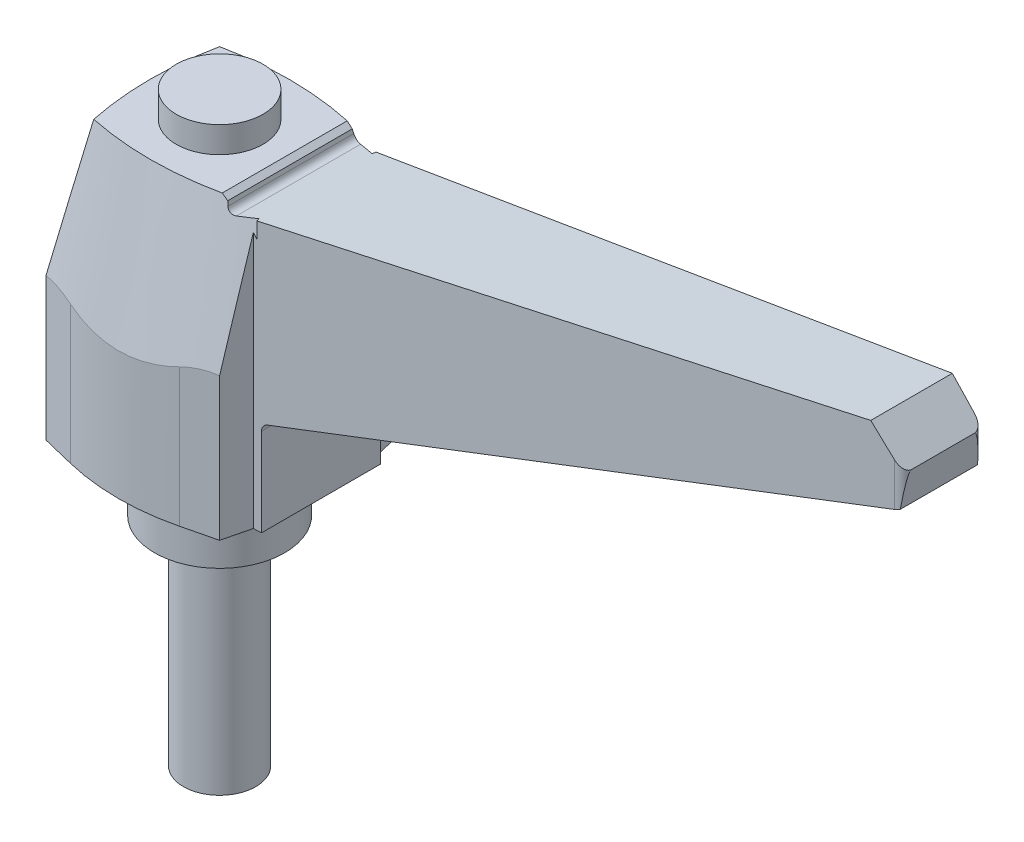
ISO-10303-21;
HEADER;
FILE_DESCRIPTION(('STEP AP214'),'2;1');
FILE_NAME('part.step','',(''),(''),'','','');
FILE_SCHEMA(('AUTOMOTIVE_DESIGN { 1 0 10303 214 1 1 1 1 }'));
ENDSEC;
DATA;
#1=APPLICATION_CONTEXT('core data for automotive mechanical design processes');
#2=APPLICATION_PROTOCOL_DEFINITION('international standard','automotive_design',2000,#1);
#3=PRODUCT_CONTEXT('',#1,'mechanical');
#4=PRODUCT('Part','Part','',(#3));
#5=PRODUCT_RELATED_PRODUCT_CATEGORY('part','',(#4));
#6=PRODUCT_DEFINITION_FORMATION('','',#4);
#7=PRODUCT_DEFINITION_CONTEXT('part definition',#1,'design');
#8=PRODUCT_DEFINITION('design','',#6,#7);
#9=PRODUCT_DEFINITION_SHAPE('','',#8);
#10=(LENGTH_UNIT() NAMED_UNIT(*) SI_UNIT(.MILLI.,.METRE.));
#11=(NAMED_UNIT(*) PLANE_ANGLE_UNIT() SI_UNIT($,.RADIAN.));
#12=(NAMED_UNIT(*) SI_UNIT($,.STERADIAN.) SOLID_ANGLE_UNIT());
#13=UNCERTAINTY_MEASURE_WITH_UNIT(LENGTH_MEASURE(1.E-05),#10,'distance_accuracy_value','');
#14=(GEOMETRIC_REPRESENTATION_CONTEXT(3) GLOBAL_UNCERTAINTY_ASSIGNED_CONTEXT((#13)) GLOBAL_UNIT_ASSIGNED_CONTEXT((#10,
#11,#12)) REPRESENTATION_CONTEXT('',''));
#15=CARTESIAN_POINT('',(0.,0.,0.));
#16=DIRECTION('',(0.,0.,1.));
#17=DIRECTION('',(1.,0.,0.));
#18=AXIS2_PLACEMENT_3D('',#15,#16,#17);
#19=CARTESIAN_POINT('',(9.72582618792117,49.8131114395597,14.0009999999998));
#20=DIRECTION('',(0.62932039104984,0.777145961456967,0.));
#21=DIRECTION('',(-0.777145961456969,0.62932039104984,0.));
#22=AXIS2_PLACEMENT_3D('',#19,#20,#21);
#23=PLANE('',#22);
#24=DIRECTION('',(0.,0.,1.));
#25=VECTOR('',#24,1.);
#26=CARTESIAN_POINT('',(9.72582618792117,49.8131114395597,14.0009999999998));
#27=LINE('',#26,#25);
#28=CARTESIAN_POINT('',(9.72582618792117,49.8131114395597,-8.60208683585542));
#29=VERTEX_POINT('',#28);
#30=CARTESIAN_POINT('',(9.72582618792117,49.8131114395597,8.60208683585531));
#31=VERTEX_POINT('',#30);
#32=EDGE_CURVE('E625',#29,#31,#27,.T.);
#33=ORIENTED_EDGE('',*,*,#32,.F.);
#34=CARTESIAN_POINT('',(9.72582618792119,49.8131114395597,-8.60208683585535));
#35=CARTESIAN_POINT('',(9.72577473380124,49.8131531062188,-8.60208976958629));
#36=CARTESIAN_POINT('',(9.72572327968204,49.8131947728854,-8.60209270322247));
#37=CARTESIAN_POINT('',(9.72562037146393,49.8132781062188,-8.6020985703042));
#38=CARTESIAN_POINT('',(9.72556891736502,49.8133197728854,-8.60210150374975));
#39=CARTESIAN_POINT('',(9.72546600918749,49.8134031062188,-8.60210737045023));
#40=CARTESIAN_POINT('',(9.72541455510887,49.8134447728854,-8.60211030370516));
#41=CARTESIAN_POINT('',(9.72531164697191,49.8135281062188,-8.60211617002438));
#42=CARTESIAN_POINT('',(9.72526019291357,49.8135697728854,-8.60211910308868));
#43=CARTESIAN_POINT('',(9.72515728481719,49.8136531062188,-8.60212496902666));
#44=CARTESIAN_POINT('',(9.72510583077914,49.8136947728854,-8.60212790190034));
#45=CARTESIAN_POINT('',(9.72500292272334,49.8137781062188,-8.60213376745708));
#46=CARTESIAN_POINT('',(9.72495146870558,49.8138197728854,-8.60213670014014));
#47=CARTESIAN_POINT('',(9.72484856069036,49.8139031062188,-8.60214256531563));
#48=CARTESIAN_POINT('',(9.7247971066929,49.8139447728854,-8.60214549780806));
#49=CARTESIAN_POINT('',(9.72469419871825,49.8140281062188,-8.60215136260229));
#50=CARTESIAN_POINT('',(9.72464274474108,49.8140697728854,-8.60215429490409));
#51=CARTESIAN_POINT('',(9.72459129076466,49.8141114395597,-8.60215722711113));
#52=B_SPLINE_CURVE_WITH_KNOTS('',3,(#34,#35,#36,#37,#38,#39,#40,#41,#42,#43,#44,#45,#46,#47,#48,
#49,#50,#51),.UNSPECIFIED.,.F.,.F.,(4,2,2,2,2,2,2,2,4),(0.,0.000198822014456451,
0.000397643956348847,0.000596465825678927,0.000795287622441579,0.000994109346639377,
0.00119293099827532,0.00139175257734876,0.00159057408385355),.UNSPECIFIED.);
#53=CARTESIAN_POINT('',(9.72459129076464,49.8141114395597,-8.60215722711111));
#54=VERTEX_POINT('',#53);
#55=EDGE_CURVE('E634',#29,#54,#52,.T.);
#56=ORIENTED_EDGE('',*,*,#55,.T.);
#57=CARTESIAN_POINT('',(7.28141417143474,51.7925572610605,33.));
#58=DIRECTION('',(0.62932039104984,0.777145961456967,0.));
#59=DIRECTION('',(0.777145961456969,-0.62932039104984,0.));
#60=AXIS2_PLACEMENT_3D('',#57,#58,#59);
#61=ELLIPSE('',#60,54.4338954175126,41.6717140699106);
#62=CARTESIAN_POINT('',(9.00107917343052,50.4,-8.63726840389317));
#63=VERTEX_POINT('',#62);
#64=EDGE_CURVE('E909',#54,#63,#61,.T.);
#65=ORIENTED_EDGE('',*,*,#64,.T.);
#66=DIRECTION('',(0.,0.,1.));
#67=VECTOR('',#66,1.);
#68=CARTESIAN_POINT('',(9.00107917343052,50.4,14.001));
#69=LINE('',#68,#67);
#70=CARTESIAN_POINT('',(9.00107917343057,50.4,8.63726840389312));
#71=VERTEX_POINT('',#70);
#72=EDGE_CURVE('E633',#71,#63,#69,.F.);
#73=ORIENTED_EDGE('',*,*,#72,.F.);
#74=CARTESIAN_POINT('',(7.2814141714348,51.7925572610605,-33.0000000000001));
#75=DIRECTION('',(0.62932039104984,0.777145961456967,0.));
#76=DIRECTION('',(0.777145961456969,-0.62932039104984,0.));
#77=AXIS2_PLACEMENT_3D('',#74,#75,#76);
#78=ELLIPSE('',#77,54.4338954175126,41.6717140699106);
#79=CARTESIAN_POINT('',(9.72459129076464,49.8141114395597,8.60215722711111));
#80=VERTEX_POINT('',#79);
#81=EDGE_CURVE('E905',#80,#71,#78,.F.);
#82=ORIENTED_EDGE('',*,*,#81,.F.);
#83=CARTESIAN_POINT('',(9.72459129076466,49.8141114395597,8.60215722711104));
#84=CARTESIAN_POINT('',(9.72464274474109,49.8140697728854,8.60215429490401));
#85=CARTESIAN_POINT('',(9.72469419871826,49.8140281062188,8.60215136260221));
#86=CARTESIAN_POINT('',(9.72479710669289,49.8139447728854,8.60214549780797));
#87=CARTESIAN_POINT('',(9.72484856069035,49.8139031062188,8.60214256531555));
#88=CARTESIAN_POINT('',(9.72495146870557,49.8138197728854,8.60213670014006));
#89=CARTESIAN_POINT('',(9.72500292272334,49.8137781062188,8.60213376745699));
#90=CARTESIAN_POINT('',(9.72510583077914,49.8136947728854,8.60212790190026));
#91=CARTESIAN_POINT('',(9.72515728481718,49.8136531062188,8.60212496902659));
#92=CARTESIAN_POINT('',(9.72526019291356,49.8135697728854,8.60211910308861));
#93=CARTESIAN_POINT('',(9.72531164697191,49.8135281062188,8.6021161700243));
#94=CARTESIAN_POINT('',(9.72541455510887,49.8134447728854,8.60211030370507));
#95=CARTESIAN_POINT('',(9.72546600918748,49.8134031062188,8.60210737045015));
#96=CARTESIAN_POINT('',(9.72556891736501,49.8133197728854,8.60210150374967));
#97=CARTESIAN_POINT('',(9.72562037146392,49.8132781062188,8.60209857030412));
#98=CARTESIAN_POINT('',(9.72572327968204,49.8131947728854,8.60209270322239));
#99=CARTESIAN_POINT('',(9.72577473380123,49.8131531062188,8.60208976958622));
#100=CARTESIAN_POINT('',(9.72582618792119,49.8131114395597,8.60208683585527));
#101=B_SPLINE_CURVE_WITH_KNOTS('',3,(#83,#84,#85,#86,#87,#88,#89,#90,#91,#92,#93,#94,#95,#96,
#97,#98,#99,#100),.UNSPECIFIED.,.F.,.F.,(4,2,2,2,2,2,2,2,4),(0.,0.000198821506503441,
0.000397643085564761,0.000596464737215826,0.000795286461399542,0.000994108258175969,
0.00119293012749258,0.00139175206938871,0.00159057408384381),.UNSPECIFIED.);
#102=EDGE_CURVE('E639',#80,#31,#101,.T.);
#103=ORIENTED_EDGE('',*,*,#102,.T.);
#104=EDGE_LOOP('',(#33,#56,#65,#73,#82,#103));
#105=FACE_BOUND('',#104,.T.);
#106=ADVANCED_FACE('F63',(#105),#23,.T.);
#107=CARTESIAN_POINT('',(9.00107917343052,50.4,14.001));
#108=DIRECTION('',(0.,1.,0.));
#109=DIRECTION('',(0.,0.,1.));
#110=AXIS2_PLACEMENT_3D('',#107,#108,#109);
#111=PLANE('',#110);
#112=CARTESIAN_POINT('',(0.,50.4,0.));
#113=DIRECTION('',(0.,1.,0.));
#114=DIRECTION('',(0.,0.,1.));
#115=AXIS2_PLACEMENT_3D('',#112,#113,#114);
#116=CIRCLE('',#115,6.);
#117=CARTESIAN_POINT('',(0.,50.4,6.00000000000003));
#118=VERTEX_POINT('',#117);
#119=EDGE_CURVE('E922',#118,#118,#116,.T.);
#120=ORIENTED_EDGE('',*,*,#119,.F.);
#121=EDGE_LOOP('',(#120));
#122=FACE_BOUND('',#121,.T.);
#123=CARTESIAN_POINT('',(0.,50.4,-33.0000000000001));
#124=DIRECTION('',(0.,1.,0.));
#125=DIRECTION('',(0.,0.,1.));
#126=AXIS2_PLACEMENT_3D('',#123,#124,#125);
#127=CIRCLE('',#126,42.5990791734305);
#128=CARTESIAN_POINT('',(-8.70100738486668,50.4,8.70100738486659));
#129=VERTEX_POINT('',#128);
#130=EDGE_CURVE('E913',#71,#129,#127,.F.);
#131=ORIENTED_EDGE('',*,*,#130,.F.);
#132=ORIENTED_EDGE('',*,*,#72,.T.);
#133=CARTESIAN_POINT('',(0.,50.4,33.));
#134=DIRECTION('',(0.,1.,0.));
#135=DIRECTION('',(0.,0.,1.));
#136=AXIS2_PLACEMENT_3D('',#133,#134,#135);
#137=CIRCLE('',#136,42.5990791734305);
#138=CARTESIAN_POINT('',(-8.70100738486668,50.4,-8.70100738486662));
#139=VERTEX_POINT('',#138);
#140=EDGE_CURVE('E917',#63,#139,#137,.T.);
#141=ORIENTED_EDGE('',*,*,#140,.T.);
#142=CARTESIAN_POINT('',(33.,50.4,0.));
#143=DIRECTION('',(0.,1.,0.));
#144=DIRECTION('',(0.,0.,1.));
#145=AXIS2_PLACEMENT_3D('',#142,#143,#144);
#146=CIRCLE('',#145,42.5990791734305);
#147=EDGE_CURVE('E918',#129,#139,#146,.F.);
#148=ORIENTED_EDGE('',*,*,#147,.F.);
#149=EDGE_LOOP('',(#131,#132,#141,#148));
#150=FACE_BOUND('',#149,.T.);
#151=ADVANCED_FACE('F805',(#122,#150),#111,.T.);
#152=CARTESIAN_POINT('',(-13.0900069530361,0.,7.54571104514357));
#153=DIRECTION('',(0.971329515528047,0.,-0.237737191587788));
#154=DIRECTION('',(-0.237737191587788,0.,-0.971329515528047));
#155=AXIS2_PLACEMENT_3D('',#152,#153,#154);
#156=PLANE('',#155);
#157=CARTESIAN_POINT('',(-11.8766994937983,31.6436860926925,12.5029553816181));
#158=CARTESIAN_POINT('',(-11.9199549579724,31.6708150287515,12.3262253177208));
#159=CARTESIAN_POINT('',(-11.9633802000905,31.6930089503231,12.1488015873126));
#160=CARTESIAN_POINT('',(-12.0504500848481,31.7273329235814,11.7930577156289));
#161=CARTESIAN_POINT('',(-12.094094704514,31.7394640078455,11.6147376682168));
#162=CARTESIAN_POINT('',(-12.2250621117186,31.7604585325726,11.0796404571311));
#163=CARTESIAN_POINT('',(-12.3125465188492,31.7540042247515,10.7222029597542));
#164=CARTESIAN_POINT('',(-12.5175132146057,31.6908810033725,9.88476477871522));
#165=CARTESIAN_POINT('',(-12.6347108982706,31.6173302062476,9.40592691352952));
#166=CARTESIAN_POINT('',(-12.8654604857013,31.4020765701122,8.46314684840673));
#167=CARTESIAN_POINT('',(-12.9790110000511,31.2603480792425,7.99921032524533));
#168=CARTESIAN_POINT('',(-13.2002667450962,30.9202544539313,7.09521951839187));
#169=CARTESIAN_POINT('',(-13.3080057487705,30.7222711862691,6.65502724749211));
#170=CARTESIAN_POINT('',(-13.5180100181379,30.2797796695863,5.79700691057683));
#171=CARTESIAN_POINT('',(-13.6202689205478,30.0352187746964,5.37920484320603));
#172=CARTESIAN_POINT('',(-13.8197721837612,29.5077891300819,4.56408876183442));
#173=CARTESIAN_POINT('',(-13.9169854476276,29.2247146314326,4.16690180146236));
#174=CARTESIAN_POINT('',(-14.1061887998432,28.6289680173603,3.39386835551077));
#175=CARTESIAN_POINT('',(-14.1981754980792,28.3162770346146,3.01803572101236));
#176=CARTESIAN_POINT('',(-14.3887540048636,27.6262131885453,2.23938376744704));
#177=CARTESIAN_POINT('',(-14.4866942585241,27.2456750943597,1.83922652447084));
#178=CARTESIAN_POINT('',(-14.6771526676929,26.4615695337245,1.06106525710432));
#179=CARTESIAN_POINT('',(-14.7696713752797,26.0580044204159,0.683058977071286));
#180=CARTESIAN_POINT('',(-14.9501211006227,25.2318807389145,-0.0542095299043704));
#181=CARTESIAN_POINT('',(-15.0380436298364,24.8092895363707,-0.413437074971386));
#182=CARTESIAN_POINT('',(-15.2097050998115,23.949398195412,-1.11479916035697));
#183=CARTESIAN_POINT('',(-15.2934440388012,23.5120980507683,-1.45693369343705));
#184=CARTESIAN_POINT('',(-15.4574460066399,22.624387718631,-2.12700113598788));
#185=CARTESIAN_POINT('',(-15.5376997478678,22.1739472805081,-2.45489609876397));
#186=CARTESIAN_POINT('',(-15.6949354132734,21.2631088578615,-3.09731826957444));
#187=CARTESIAN_POINT('',(-15.7719173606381,20.8027109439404,-3.41184557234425));
#188=CARTESIAN_POINT('',(-15.9229093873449,19.8739831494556,-4.02875793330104));
#189=CARTESIAN_POINT('',(-15.996922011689,19.4056605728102,-4.33115338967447));
#190=CARTESIAN_POINT('',(-16.1423576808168,18.4619464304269,-4.92536398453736));
#191=CARTESIAN_POINT('',(-16.2137806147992,17.98655456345,-5.21717867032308));
#192=CARTESIAN_POINT('',(-16.3939489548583,16.7597967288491,-5.95329751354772));
#193=CARTESIAN_POINT('',(-16.5010151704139,16.0040600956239,-6.39074095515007));
#194=CARTESIAN_POINT('',(-16.6575968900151,14.8644018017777,-7.03049128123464));
#195=CARTESIAN_POINT('',(-16.7089428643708,14.4848885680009,-7.24027696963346));
#196=CARTESIAN_POINT('',(-16.8105203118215,13.7232449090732,-7.65529479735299));
#197=CARTESIAN_POINT('',(-16.860751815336,13.3411145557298,-7.86052706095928));
#198=CARTESIAN_POINT('',(-16.9104688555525,12.9577983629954,-8.0636573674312));
#199=B_SPLINE_CURVE_WITH_KNOTS('',3,(#157,#158,#159,#160,#161,#162,#163,#164,#165,#166,#167,
#168,#169,#170,#171,#172,#173,#174,#175,#176,#177,#178,#179,#180,#181,#182,#183,#184,#185,#186,
#187,#188,#189,#190,#191,#192,#193,#194,#195,#196,#197,#198),.UNSPECIFIED.,.F.,.F.,(4,2,2,2,2,2,
2,2,2,2,2,2,2,2,2,2,2,2,2,2,4),(0.,0.551759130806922,1.10346163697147,2.20524169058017,
3.69499444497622,5.18530815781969,6.66573762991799,8.14785044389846,9.63821702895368,
11.1295395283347,12.8108593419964,14.4920076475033,16.1761584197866,17.8603099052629,
19.5487039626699,21.237086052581,22.9239886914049,24.6109634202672,27.2497707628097,
28.5597435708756,29.8696805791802),.UNSPECIFIED.);
#200=CARTESIAN_POINT('',(-11.9998393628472,31.7073363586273,11.9998393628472));
#201=VERTEX_POINT('',#200);
#202=CARTESIAN_POINT('',(-13.090006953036,31.0897354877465,7.54571104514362));
#203=VERTEX_POINT('',#202);
#204=EDGE_CURVE('E436',#201,#203,#199,.T.);
#205=ORIENTED_EDGE('',*,*,#204,.T.);
#206=DIRECTION('',(0.,1.,0.));
#207=VECTOR('',#206,1.);
#208=CARTESIAN_POINT('',(-13.090006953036,0.,7.54571104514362));
#209=LINE('',#208,#207);
#210=CARTESIAN_POINT('',(-13.090006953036,12.,7.54571104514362));
#211=VERTEX_POINT('',#210);
#212=EDGE_CURVE('E416',#203,#211,#209,.F.);
#213=ORIENTED_EDGE('',*,*,#212,.T.);
#214=DIRECTION('',(-0.237737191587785,0.,-0.971329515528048));
#215=VECTOR('',#214,1.);
#216=CARTESIAN_POINT('',(-12.3996873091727,12.,10.3661693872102));
#217=LINE('',#216,#215);
#218=CARTESIAN_POINT('',(-11.9998393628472,12.,11.9998393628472));
#219=VERTEX_POINT('',#218);
#220=EDGE_CURVE('E1014',#219,#211,#217,.T.);
#221=ORIENTED_EDGE('',*,*,#220,.F.);
#222=DIRECTION('',(0.,-1.,0.));
#223=VECTOR('',#222,1.);
#224=CARTESIAN_POINT('',(-11.9998393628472,0.,11.9998393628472));
#225=LINE('',#224,#223);
#226=EDGE_CURVE('E836',#219,#201,#225,.F.);
#227=ORIENTED_EDGE('',*,*,#226,.T.);
#228=EDGE_LOOP('',(#205,#213,#221,#227));
#229=FACE_BOUND('',#228,.T.);
#230=ADVANCED_FACE('F800',(#229),#156,.F.);
#231=CARTESIAN_POINT('',(-12.399687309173,0.,-10.3661693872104));
#232=DIRECTION('',(0.971329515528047,0.,0.237737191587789));
#233=DIRECTION('',(0.237737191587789,0.,-0.971329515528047));
#234=AXIS2_PLACEMENT_3D('',#231,#232,#233);
#235=PLANE('',#234);
#236=DIRECTION('',(0.237737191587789,0.,-0.971329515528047));
#237=VECTOR('',#236,1.);
#238=CARTESIAN_POINT('',(-13.090006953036,12.,-7.54571104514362));
#239=LINE('',#238,#237);
#240=CARTESIAN_POINT('',(-13.0900069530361,12.,-7.54571104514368));
#241=VERTEX_POINT('',#240);
#242=CARTESIAN_POINT('',(-11.9998393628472,12.,-11.9998393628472));
#243=VERTEX_POINT('',#242);
#244=EDGE_CURVE('E1011',#241,#243,#239,.T.);
#245=ORIENTED_EDGE('',*,*,#244,.F.);
#246=DIRECTION('',(0.,1.,0.));
#247=VECTOR('',#246,1.);
#248=CARTESIAN_POINT('',(-13.0900069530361,0.,-7.54571104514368));
#249=LINE('',#248,#247);
#250=CARTESIAN_POINT('',(-13.0900069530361,31.0897354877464,-7.54571104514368));
#251=VERTEX_POINT('',#250);
#252=EDGE_CURVE('E404',#241,#251,#249,.T.);
#253=ORIENTED_EDGE('',*,*,#252,.T.);
#254=CARTESIAN_POINT('',(-14.9368530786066,25.2877481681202,-1.38777878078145E-13));
#255=CARTESIAN_POINT('',(-14.8940385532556,25.4891625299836,-0.174928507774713));
#256=CARTESIAN_POINT('',(-14.8506955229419,25.6885845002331,-0.35201634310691));
#257=CARTESIAN_POINT('',(-14.7628683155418,26.0829929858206,-0.710854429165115));
#258=CARTESIAN_POINT('',(-14.718383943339,26.2779787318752,-0.892605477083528));
#259=CARTESIAN_POINT('',(-14.5828483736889,26.8566403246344,-1.44636695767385));
#260=CARTESIAN_POINT('',(-14.4899669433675,27.2328238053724,-1.82585522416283));
#261=CARTESIAN_POINT('',(-14.297478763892,27.9645715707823,-2.61230958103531));
#262=CARTESIAN_POINT('',(-14.1978002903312,28.3198042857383,-3.01956871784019));
#263=CARTESIAN_POINT('',(-13.9922862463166,28.9963441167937,-3.8592432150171));
#264=CARTESIAN_POINT('',(-13.8864591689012,29.3176963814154,-4.29162387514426));
#265=CARTESIAN_POINT('',(-13.6691853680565,29.9138198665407,-5.17934554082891));
#266=CARTESIAN_POINT('',(-13.5578120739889,30.1890586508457,-5.63438653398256));
#267=CARTESIAN_POINT('',(-13.3286201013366,30.6840757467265,-6.57080260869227));
#268=CARTESIAN_POINT('',(-13.2108226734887,30.904024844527,-7.05209086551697));
#269=CARTESIAN_POINT('',(-12.9790076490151,31.2603569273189,-7.99922401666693));
#270=CARTESIAN_POINT('',(-12.865460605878,31.4020777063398,-8.46314635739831));
#271=CARTESIAN_POINT('',(-12.6347131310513,31.6173268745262,-9.40591779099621));
#272=CARTESIAN_POINT('',(-12.5175140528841,31.6908802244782,-9.88476135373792));
#273=CARTESIAN_POINT('',(-12.3125516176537,31.754003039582,-10.7221821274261));
#274=CARTESIAN_POINT('',(-12.2250726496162,31.7604578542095,-11.0795974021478));
#275=CARTESIAN_POINT('',(-12.0941077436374,31.7394672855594,-11.6146843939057));
#276=CARTESIAN_POINT('',(-12.0504603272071,31.7273363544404,-11.7930158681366));
#277=CARTESIAN_POINT('',(-11.9633851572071,31.6930115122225,-12.1487813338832));
#278=CARTESIAN_POINT('',(-11.9199574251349,31.6708166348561,-12.3262152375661));
#279=CARTESIAN_POINT('',(-11.8766995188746,31.6436861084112,-12.5029552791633));
#280=B_SPLINE_CURVE_WITH_KNOTS('',3,(#254,#255,#256,#257,#258,#259,#260,#261,#262,#263,#264,
#265,#266,#267,#268,#269,#270,#271,#272,#273,#274,#275,#276,#277,#278,#279),.UNSPECIFIED.,.F.,
.F.,(4,2,2,2,2,2,2,2,2,2,2,2,4),(0.,0.810528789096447,1.62119707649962,3.24732604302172,
4.8945917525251,6.53963383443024,8.16682763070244,9.78893159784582,11.2792377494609,
12.7689979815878,13.8707116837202,14.4224492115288,14.974239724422),.UNSPECIFIED.);
#281=CARTESIAN_POINT('',(-11.9998393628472,31.7073363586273,-11.9998393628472));
#282=VERTEX_POINT('',#281);
#283=EDGE_CURVE('E461',#251,#282,#280,.T.);
#284=ORIENTED_EDGE('',*,*,#283,.T.);
#285=DIRECTION('',(0.,-1.,0.));
#286=VECTOR('',#285,1.);
#287=CARTESIAN_POINT('',(-11.9998393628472,0.,-11.9998393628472));
#288=LINE('',#287,#286);
#289=EDGE_CURVE('E851',#243,#282,#288,.F.);
#290=ORIENTED_EDGE('',*,*,#289,.F.);
#291=EDGE_LOOP('',(#245,#253,#284,#290));
#292=FACE_BOUND('',#291,.T.);
#293=ADVANCED_FACE('F797',(#292),#235,.F.);
#294=CARTESIAN_POINT('',(-7.54571104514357,0.,-13.090006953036));
#295=DIRECTION('',(0.237737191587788,0.,0.971329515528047));
#296=DIRECTION('',(0.971329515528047,0.,-0.237737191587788));
#297=AXIS2_PLACEMENT_3D('',#294,#295,#296);
#298=PLANE('',#297);
#299=CARTESIAN_POINT('',(-14.1473670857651,31.2470390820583,-11.4742224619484));
#300=CARTESIAN_POINT('',(-13.8421718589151,31.3475673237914,-11.5489203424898));
#301=CARTESIAN_POINT('',(-13.5325333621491,31.4343670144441,-11.6247057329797));
#302=CARTESIAN_POINT('',(-12.9065764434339,31.5782441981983,-11.777911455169));
#303=CARTESIAN_POINT('',(-12.5902529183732,31.6352980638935,-11.8553330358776));
#304=CARTESIAN_POINT('',(-11.9560635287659,31.716937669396,-12.0105536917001));
#305=CARTESIAN_POINT('',(-11.6382280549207,31.7417688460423,-12.0883453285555));
#306=CARTESIAN_POINT('',(-11.0019636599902,31.7588408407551,-12.2440738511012));
#307=CARTESIAN_POINT('',(-10.6835351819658,31.7511002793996,-12.3220106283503));
#308=CARTESIAN_POINT('',(-9.88462820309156,31.6908544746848,-12.5175466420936));
#309=CARTESIAN_POINT('',(-9.40553354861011,31.6172635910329,-12.6348071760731));
#310=CARTESIAN_POINT('',(-8.4627281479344,31.4019576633,-12.8655629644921));
#311=CARTESIAN_POINT('',(-7.99901008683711,31.2602755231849,-12.9790600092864));
#312=CARTESIAN_POINT('',(-7.09534458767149,30.9202987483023,-13.2002361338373));
#313=CARTESIAN_POINT('',(-6.65526277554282,30.7223762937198,-13.3079481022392));
#314=CARTESIAN_POINT('',(-5.79744808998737,30.2800235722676,-13.5179020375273));
#315=CARTESIAN_POINT('',(-5.37974162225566,30.0355398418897,-13.6201375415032));
#316=CARTESIAN_POINT('',(-4.56440975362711,29.5080232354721,-13.8196936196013));
#317=CARTESIAN_POINT('',(-4.16693357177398,29.2247486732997,-13.9169776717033));
#318=CARTESIAN_POINT('',(-3.39371147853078,28.6288375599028,-14.1062271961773));
#319=CARTESIAN_POINT('',(-3.0179593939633,28.3162094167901,-14.1981941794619));
#320=CARTESIAN_POINT('',(-2.23938860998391,27.6262174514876,-14.3887528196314));
#321=CARTESIAN_POINT('',(-1.83923575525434,27.2456838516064,-14.4866919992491));
#322=CARTESIAN_POINT('',(-1.06098604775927,26.4614902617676,-14.6771720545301));
#323=CARTESIAN_POINT('',(-0.682892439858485,26.0578268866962,-14.7697121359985));
#324=CARTESIAN_POINT('',(0.054508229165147,25.2315369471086,-14.9501942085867));
#325=CARTESIAN_POINT('',(0.413782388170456,24.808879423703,-15.0381281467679));
#326=CARTESIAN_POINT('',(1.11521113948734,23.9488798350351,-15.2098059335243));
#327=CARTESIAN_POINT('',(1.45736681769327,23.5115387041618,-15.293550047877));
#328=CARTESIAN_POINT('',(2.12739370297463,22.623853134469,-15.4575420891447));
#329=CARTESIAN_POINT('',(2.45523062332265,22.1734813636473,-15.5377816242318));
#330=CARTESIAN_POINT('',(3.09757277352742,21.2627396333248,-15.6949977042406));
#331=CARTESIAN_POINT('',(3.41207679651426,20.8023687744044,-15.7719739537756));
#332=CARTESIAN_POINT('',(4.02892930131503,19.8737192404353,-15.9229513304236));
#333=CARTESIAN_POINT('',(4.33128876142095,19.4054482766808,-15.9969551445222));
#334=CARTESIAN_POINT('',(4.92542987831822,18.4618390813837,-16.1423738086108));
#335=CARTESIAN_POINT('',(5.21721108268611,17.9865005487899,-16.2137885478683));
#336=CARTESIAN_POINT('',(5.9532694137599,16.7598435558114,-16.393942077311));
#337=CARTESIAN_POINT('',(6.39068620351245,16.0041546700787,-16.5010017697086));
#338=CARTESIAN_POINT('',(7.03042514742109,14.8645210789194,-16.6575807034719));
#339=CARTESIAN_POINT('',(7.24022462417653,14.4849839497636,-16.7089300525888));
#340=CARTESIAN_POINT('',(7.65526917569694,13.7232926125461,-16.8105140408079));
#341=CARTESIAN_POINT('',(7.86051438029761,13.3411384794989,-16.860748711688));
#342=CARTESIAN_POINT('',(8.06365736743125,12.9577983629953,-16.9104688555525));
#343=B_SPLINE_CURVE_WITH_KNOTS('',3,(#299,#300,#301,#302,#303,#304,#305,#306,#307,#308,#309,
#310,#311,#312,#313,#314,#315,#316,#317,#318,#319,#320,#321,#322,#323,#324,#325,#326,#327,#328,
#329,#330,#331,#332,#333,#334,#335,#336,#337,#338,#339,#340,#341,#342),.UNSPECIFIED.,.F.,.F.,(4,
2,2,2,2,2,2,2,2,2,2,2,2,2,2,2,2,2,2,2,2,4),(0.,0.989628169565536,1.98004121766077,
2.96286523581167,3.94512747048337,5.43552034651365,6.92519373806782,8.40522979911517,
9.88697565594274,11.3784134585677,12.8694253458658,14.5507258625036,16.2322730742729,
17.9166682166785,19.6009563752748,21.2890782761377,22.9773526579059,24.6640648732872,
26.3508491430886,28.9894913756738,30.2995475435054,31.609566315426),.UNSPECIFIED.);
#344=CARTESIAN_POINT('',(-7.54571104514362,31.0897354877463,-13.090006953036));
#345=VERTEX_POINT('',#344);
#346=EDGE_CURVE('E611',#282,#345,#343,.T.);
#347=ORIENTED_EDGE('',*,*,#346,.T.);
#348=DIRECTION('',(0.,1.,0.));
#349=VECTOR('',#348,1.);
#350=CARTESIAN_POINT('',(-7.54571104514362,0.,-13.090006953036));
#351=LINE('',#350,#349);
#352=CARTESIAN_POINT('',(-7.54571104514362,12.,-13.090006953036));
#353=VERTEX_POINT('',#352);
#354=EDGE_CURVE('E73',#345,#353,#351,.F.);
#355=ORIENTED_EDGE('',*,*,#354,.T.);
#356=DIRECTION('',(0.971329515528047,0.,-0.237737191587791));
#357=VECTOR('',#356,1.);
#358=CARTESIAN_POINT('',(-10.3661693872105,12.,-12.3996873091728));
#359=LINE('',#358,#357);
#360=EDGE_CURVE('E1009',#243,#353,#359,.T.);
#361=ORIENTED_EDGE('',*,*,#360,.F.);
#362=ORIENTED_EDGE('',*,*,#289,.T.);
#363=EDGE_LOOP('',(#347,#355,#361,#362));
#364=FACE_BOUND('',#363,.T.);
#365=ADVANCED_FACE('F794',(#364),#298,.F.);
#366=CARTESIAN_POINT('',(10.3661693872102,0.,-12.3996873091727));
#367=DIRECTION('',(-0.237737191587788,0.,0.971329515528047));
#368=DIRECTION('',(0.971329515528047,0.,0.237737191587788));
#369=AXIS2_PLACEMENT_3D('',#366,#367,#368);
#370=PLANE('',#369);
#371=DIRECTION('',(0.971329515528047,0.,0.237737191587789));
#372=VECTOR('',#371,1.);
#373=CARTESIAN_POINT('',(7.54571104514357,12.,-13.0900069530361));
#374=LINE('',#373,#372);
#375=CARTESIAN_POINT('',(7.54571104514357,12.,-13.0900069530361));
#376=VERTEX_POINT('',#375);
#377=CARTESIAN_POINT('',(11.9998393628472,12.,-11.9998393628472));
#378=VERTEX_POINT('',#377);
#379=EDGE_CURVE('E1155',#376,#378,#374,.T.);
#380=ORIENTED_EDGE('',*,*,#379,.F.);
#381=DIRECTION('',(0.,1.,0.));
#382=VECTOR('',#381,1.);
#383=CARTESIAN_POINT('',(7.54571104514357,0.,-13.0900069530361));
#384=LINE('',#383,#382);
#385=CARTESIAN_POINT('',(7.54571104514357,31.0897354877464,-13.0900069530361));
#386=VERTEX_POINT('',#385);
#387=EDGE_CURVE('E1074',#376,#386,#384,.T.);
#388=ORIENTED_EDGE('',*,*,#387,.T.);
#389=CARTESIAN_POINT('',(1.11022302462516E-13,25.2877481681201,-14.9368530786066));
#390=CARTESIAN_POINT('',(0.174837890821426,25.4890582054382,-14.8940607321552));
#391=CARTESIAN_POINT('',(0.351832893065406,25.6883779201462,-14.85074042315));
#392=CARTESIAN_POINT('',(0.710480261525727,26.0825866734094,-14.7629598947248));
#393=CARTESIAN_POINT('',(0.892133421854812,26.2774749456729,-14.7184994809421));
#394=CARTESIAN_POINT('',(1.44559282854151,26.8558524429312,-14.5830378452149));
#395=CARTESIAN_POINT('',(1.82486865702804,27.2318578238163,-14.4902084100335));
#396=CARTESIAN_POINT('',(2.61127632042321,27.9636587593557,-14.2977316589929));
#397=CARTESIAN_POINT('',(3.01872449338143,28.3190964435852,-14.198006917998));
#398=CARTESIAN_POINT('',(3.85880194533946,28.9960161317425,-13.9923942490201));
#399=CARTESIAN_POINT('',(4.29139647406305,29.3175433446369,-13.8865148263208));
#400=CARTESIAN_POINT('',(5.17945441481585,29.9138933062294,-13.6691587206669));
#401=CARTESIAN_POINT('',(5.63461036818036,30.189195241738,-13.5577572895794));
#402=CARTESIAN_POINT('',(6.57104313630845,30.6841847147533,-13.3285612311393));
#403=CARTESIAN_POINT('',(7.05221938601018,30.9040700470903,-13.2107912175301));
#404=CARTESIAN_POINT('',(7.99903514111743,31.2602887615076,-12.9790538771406));
#405=CARTESIAN_POINT('',(8.46275142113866,31.4019660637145,-12.8655572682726));
#406=CARTESIAN_POINT('',(9.40554908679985,31.6172640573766,-12.6348033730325));
#407=CARTESIAN_POINT('',(9.88463716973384,31.6908546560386,-12.517544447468));
#408=CARTESIAN_POINT('',(10.6834880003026,31.7510970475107,-12.3220221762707));
#409=CARTESIAN_POINT('',(11.0018680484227,31.7588386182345,-12.2440972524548));
#410=CARTESIAN_POINT('',(11.6380399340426,31.7417786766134,-12.0883913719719));
#411=CARTESIAN_POINT('',(11.9558313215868,31.7169582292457,-12.0106105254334));
#412=CARTESIAN_POINT('',(12.5900257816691,31.6353366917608,-11.8553886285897));
#413=CARTESIAN_POINT('',(12.9063973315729,31.5782809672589,-11.7779552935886));
#414=CARTESIAN_POINT('',(13.5324463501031,31.4343914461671,-11.6247270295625));
#415=CARTESIAN_POINT('',(13.8421289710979,31.3475815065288,-11.5489308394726));
#416=CARTESIAN_POINT('',(14.1473670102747,31.2470391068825,-11.474222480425));
#417=B_SPLINE_CURVE_WITH_KNOTS('',3,(#389,#390,#391,#392,#393,#394,#395,#396,#397,#398,#399,
#400,#401,#402,#403,#404,#405,#406,#407,#408,#409,#410,#411,#412,#413,#414,#415,#416),
.UNSPECIFIED.,.F.,.F.,(4,2,2,2,2,2,2,2,2,2,2,2,2,4),(0.,0.810109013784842,1.62035706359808,
3.24564479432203,4.89375186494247,6.53963316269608,8.16722926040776,9.78893108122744,
11.2786351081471,12.7689972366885,13.7511120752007,14.7337982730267,15.7243577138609,
16.7141247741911),.UNSPECIFIED.);
#418=CARTESIAN_POINT('',(11.9998393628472,31.7073363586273,-11.9998393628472));
#419=VERTEX_POINT('',#418);
#420=EDGE_CURVE('E754',#386,#419,#417,.T.);
#421=ORIENTED_EDGE('',*,*,#420,.T.);
#422=DIRECTION('',(0.,-1.,0.));
#423=VECTOR('',#422,1.);
#424=CARTESIAN_POINT('',(11.9998393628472,0.,-11.9998393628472));
#425=LINE('',#424,#423);
#426=EDGE_CURVE('E840',#378,#419,#425,.F.);
#427=ORIENTED_EDGE('',*,*,#426,.F.);
#428=EDGE_LOOP('',(#380,#388,#421,#427));
#429=FACE_BOUND('',#428,.T.);
#430=ADVANCED_FACE('F767',(#429),#370,.F.);
#431=CARTESIAN_POINT('',(12.6467630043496,0.,-9.35668528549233));
#432=DIRECTION('',(-0.971329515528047,0.,0.237737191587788));
#433=DIRECTION('',(0.237737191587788,0.,0.971329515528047));
#434=AXIS2_PLACEMENT_3D('',#431,#432,#433);
#435=PLANE('',#434);
#436=CARTESIAN_POINT('',(12.6467630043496,42.8475367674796,-9.35668528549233));
#437=CARTESIAN_POINT('',(12.524469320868,40.7596889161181,-9.85634402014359));
#438=CARTESIAN_POINT('',(12.3996873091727,38.6149571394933,-10.3661693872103));
#439=B_SPLINE_CURVE_WITH_KNOTS('',2,(#436,#437,#438),.UNSPECIFIED.,.F.,.F.,(3,3),(0.,1.),.UNSPECIFIED.);
#440=CARTESIAN_POINT('',(12.3996873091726,38.6149571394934,-10.3661693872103));
#441=VERTEX_POINT('',#440);
#442=CARTESIAN_POINT('',(12.6467630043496,42.8475367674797,-9.35668528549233));
#443=VERTEX_POINT('',#442);
#444=EDGE_CURVE('E606',#441,#443,#439,.F.);
#445=ORIENTED_EDGE('',*,*,#444,.T.);
#446=CARTESIAN_POINT('',(12.6467630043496,42.8475367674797,-9.35668528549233));
#447=CARTESIAN_POINT('',(12.7335365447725,44.3289543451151,-9.00215219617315));
#448=CARTESIAN_POINT('',(12.8206086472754,45.8100623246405,-8.64639926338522));
#449=CARTESIAN_POINT('',(12.9954081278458,48.7715955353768,-7.93221612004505));
#450=CARTESIAN_POINT('',(13.0831355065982,50.2520207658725,-7.57378590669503));
#451=CARTESIAN_POINT('',(13.3473867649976,54.6921598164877,-6.49412712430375));
#452=CARTESIAN_POINT('',(13.5249805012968,57.6507495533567,-5.76852741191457));
#453=CARTESIAN_POINT('',(13.8835557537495,63.5633485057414,-4.30348643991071));
#454=CARTESIAN_POINT('',(14.0645362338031,66.5173588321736,-3.56404941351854));
#455=CARTESIAN_POINT('',(14.4307158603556,72.42080526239,-2.0679390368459));
#456=CARTESIAN_POINT('',(14.6159150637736,75.3702413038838,-1.3112654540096));
#457=CARTESIAN_POINT('',(14.8976997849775,79.7902360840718,-0.159969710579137));
#458=CARTESIAN_POINT('',(14.9923027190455,81.2630324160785,0.226552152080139));
#459=CARTESIAN_POINT('',(15.1830071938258,84.2069077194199,1.00571877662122));
#460=CARTESIAN_POINT('',(15.2791087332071,85.6779866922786,1.39836353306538));
#461=CARTESIAN_POINT('',(15.4730105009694,88.618105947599,2.19059342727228));
#462=CARTESIAN_POINT('',(15.5708106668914,90.0871463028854,2.59017830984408));
#463=CARTESIAN_POINT('',(15.7683621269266,93.0229119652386,3.39731985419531));
#464=CARTESIAN_POINT('',(15.8681134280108,94.4896372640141,3.80487654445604));
#465=CARTESIAN_POINT('',(16.069902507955,97.4207957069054,4.62933185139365));
#466=CARTESIAN_POINT('',(16.1719409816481,98.8852280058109,5.04623330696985));
#467=CARTESIAN_POINT('',(16.3786541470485,101.810783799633,5.89080708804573));
#468=CARTESIAN_POINT('',(16.4833288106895,103.271907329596,6.31847929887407));
#469=CARTESIAN_POINT('',(16.6958099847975,106.190327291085,7.18661959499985));
#470=CARTESIAN_POINT('',(16.8036168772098,107.647623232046,7.62708924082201));
#471=CARTESIAN_POINT('',(16.9681406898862,109.829841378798,8.29928879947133));
#472=CARTESIAN_POINT('',(17.0234519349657,110.556640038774,8.52527550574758));
#473=CARTESIAN_POINT('',(17.135114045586,112.008828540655,8.98149652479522));
#474=CARTESIAN_POINT('',(17.1914649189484,112.734218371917,9.21173086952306));
#475=CARTESIAN_POINT('',(17.2483863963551,113.458819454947,9.44429654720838));
#476=B_SPLINE_CURVE_WITH_KNOTS('',3,(#446,#447,#448,#449,#450,#451,#452,#453,#454,#455,#456,
#457,#458,#459,#460,#461,#462,#463,#464,#465,#466,#467,#468,#469,#470,#471,#472,#473,#474,#475),
.UNSPECIFIED.,.F.,.F.,(4,2,2,2,2,2,2,2,2,2,2,2,2,2,4),(0.,4.57715872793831,9.15432223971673,
18.3086104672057,27.460142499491,36.6117980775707,41.188609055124,45.765415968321,
50.3420549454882,54.9187102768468,59.4967753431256,64.0747916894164,68.6533686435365,
70.9427428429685,73.2321342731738),.UNSPECIFIED.);
#477=CARTESIAN_POINT('',(12.9176291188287,47.4538037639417,-8.24999999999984));
#478=VERTEX_POINT('',#477);
#479=EDGE_CURVE('E861',#443,#478,#476,.T.);
#480=ORIENTED_EDGE('',*,*,#479,.T.);
#481=DIRECTION('',(0.,-1.,0.));
#482=VECTOR('',#481,1.);
#483=CARTESIAN_POINT('',(12.917629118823,0.,-8.25000000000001));
#484=LINE('',#483,#482);
#485=CARTESIAN_POINT('',(12.917629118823,12.,-8.25000000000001));
#486=VERTEX_POINT('',#485);
#487=EDGE_CURVE('E869',#478,#486,#484,.T.);
#488=ORIENTED_EDGE('',*,*,#487,.T.);
#489=DIRECTION('',(0.237737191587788,0.,0.971329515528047));
#490=VECTOR('',#489,1.);
#491=CARTESIAN_POINT('',(12.3996873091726,12.,-10.3661693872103));
#492=LINE('',#491,#490);
#493=EDGE_CURVE('E1160',#378,#486,#492,.T.);
#494=ORIENTED_EDGE('',*,*,#493,.F.);
#495=ORIENTED_EDGE('',*,*,#426,.T.);
#496=CARTESIAN_POINT('',(11.9998393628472,31.7073363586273,-11.9998393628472));
#497=CARTESIAN_POINT('',(12.0898112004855,33.2692914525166,-11.6322389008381));
#498=CARTESIAN_POINT('',(12.1800535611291,34.8309707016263,-11.2635331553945));
#499=CARTESIAN_POINT('',(12.3611301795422,37.9537231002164,-10.5237033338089));
#500=CARTESIAN_POINT('',(12.4519644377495,39.5147962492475,-10.1525792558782));
#501=CARTESIAN_POINT('',(12.7254308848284,44.1970171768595,-9.03526971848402));
#502=CARTESIAN_POINT('',(12.9090269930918,47.3171707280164,-8.28514594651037));
#503=CARTESIAN_POINT('',(13.2792624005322,53.5536117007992,-6.77246475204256));
#504=CARTESIAN_POINT('',(13.4659010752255,56.6698997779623,-6.00990988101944));
#505=CARTESIAN_POINT('',(13.8429247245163,62.8984990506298,-4.46949377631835));
#506=CARTESIAN_POINT('',(14.0333097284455,66.0108102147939,-3.69163242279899));
#507=CARTESIAN_POINT('',(14.3223871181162,70.6756721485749,-2.51054081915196));
#508=CARTESIAN_POINT('',(14.4193365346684,72.2301350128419,-2.11443186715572));
#509=CARTESIAN_POINT('',(14.6145441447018,75.3376064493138,-1.31686665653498));
#510=CARTESIAN_POINT('',(14.712802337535,76.8906150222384,-0.915410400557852));
#511=CARTESIAN_POINT('',(14.9107931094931,79.9949352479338,-0.106473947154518));
#512=CARTESIAN_POINT('',(15.0105256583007,81.5462469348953,0.301006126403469));
#513=CARTESIAN_POINT('',(15.2116691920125,84.6469434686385,1.12282390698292));
#514=CARTESIAN_POINT('',(15.3130801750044,86.1963283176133,1.53716160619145));
#515=CARTESIAN_POINT('',(15.5178461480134,89.2931715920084,2.37377968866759));
#516=CARTESIAN_POINT('',(15.6212015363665,90.8406295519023,2.79606169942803));
#517=CARTESIAN_POINT('',(15.8301353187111,93.9328801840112,3.64970831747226));
#518=CARTESIAN_POINT('',(15.9357136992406,95.4776728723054,4.08107286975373));
#519=CARTESIAN_POINT('',(16.1494745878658,98.5641987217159,4.95444173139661));
#520=CARTESIAN_POINT('',(16.2576572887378,100.105931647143,5.39644682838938));
#521=CARTESIAN_POINT('',(16.422236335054,102.4156409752,6.06887205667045));
#522=CARTESIAN_POINT('',(16.4774807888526,103.185070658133,6.29458587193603));
#523=CARTESIAN_POINT('',(16.5888130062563,104.722853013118,6.74945903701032));
#524=CARTESIAN_POINT('',(16.644900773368,105.491205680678,6.97861840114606));
#525=CARTESIAN_POINT('',(16.7014476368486,106.258962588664,7.20965350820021));
#526=B_SPLINE_CURVE_WITH_KNOTS('',3,(#496,#497,#498,#499,#500,#501,#502,#503,#504,#505,#506,
#507,#508,#509,#510,#511,#512,#513,#514,#515,#516,#517,#518,#519,#520,#521,#522,#523,#524,#525),
.UNSPECIFIED.,.F.,.F.,(4,2,2,2,2,2,2,2,2,2,2,2,2,2,4),(0.,4.82144689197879,9.64289735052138,
19.2857850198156,28.9267178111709,38.5677261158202,43.3889115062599,48.2100945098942,
53.0311785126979,57.8522570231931,62.6743341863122,67.4963821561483,72.3187881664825,
74.7300429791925,77.1413078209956),.UNSPECIFIED.);
#527=EDGE_CURVE('E844',#419,#441,#526,.T.);
#528=ORIENTED_EDGE('',*,*,#527,.T.);
#529=EDGE_LOOP('',(#445,#480,#488,#494,#495,#528));
#530=FACE_BOUND('',#529,.T.);
#531=ADVANCED_FACE('F756',(#530),#435,.F.);
#532=CARTESIAN_POINT('',(14.4111382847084,36.5354230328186,-11.3529230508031));
#533=DIRECTION('',(0.951056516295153,0.,0.309016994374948));
#534=DIRECTION('',(0.309016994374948,0.,-0.951056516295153));
#535=AXIS2_PLACEMENT_3D('',#532,#533,#534);
#536=PLANE('',#535);
#537=DIRECTION('',(-0.308463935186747,-0.0598019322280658,0.949354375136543));
#538=VECTOR('',#537,1.);
#539=CARTESIAN_POINT('',(13.4411413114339,49.0620564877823,-8.36757933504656));
#540=LINE('',#539,#538);
#541=CARTESIAN_POINT('',(13.3980084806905,49.0536943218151,-8.23483013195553));
#542=VERTEX_POINT('',#541);
#543=CARTESIAN_POINT('',(13.2541021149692,49.0257951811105,-7.79193187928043));
#544=VERTEX_POINT('',#543);
#545=EDGE_CURVE('E630',#542,#544,#540,.T.);
#546=ORIENTED_EDGE('',*,*,#545,.F.);
#547=DIRECTION('',(0.,1.,0.));
#548=VECTOR('',#547,1.);
#549=CARTESIAN_POINT('',(13.3980084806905,0.,-8.23483013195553));
#550=LINE('',#549,#548);
#551=CARTESIAN_POINT('',(13.3980084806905,46.8348923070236,-8.2348301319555));
#552=VERTEX_POINT('',#551);
#553=EDGE_CURVE('E1002',#542,#552,#550,.F.);
#554=ORIENTED_EDGE('',*,*,#553,.T.);
#555=DIRECTION('',(0.0642482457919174,-0.978147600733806,-0.197735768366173));
#556=VECTOR('',#555,1.);
#557=CARTESIAN_POINT('',(14.0174146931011,37.4047406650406,-10.141166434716));
#558=LINE('',#557,#556);
#559=EDGE_CURVE('E601',#552,#544,#558,.F.);
#560=ORIENTED_EDGE('',*,*,#559,.T.);
#561=EDGE_LOOP('',(#546,#554,#560));
#562=FACE_BOUND('',#561,.T.);
#563=ADVANCED_FACE('F766',(#562),#536,.F.);
#564=CARTESIAN_POINT('',(9.84239987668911,49.2646753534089,14.001));
#565=DIRECTION('',(0.978147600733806,0.20791169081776,0.));
#566=DIRECTION('',(-0.20791169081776,0.978147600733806,0.));
#567=AXIS2_PLACEMENT_3D('',#564,#565,#566);
#568=PLANE('',#567);
#569=CARTESIAN_POINT('',(9.72582618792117,49.8131114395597,8.60208683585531));
#570=CARTESIAN_POINT('',(9.76468294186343,49.6303047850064,8.63290723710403));
#571=CARTESIAN_POINT('',(9.80354084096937,49.4474927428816,8.66369435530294));
#572=CARTESIAN_POINT('',(10.4488038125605,46.4117691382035,9.17437191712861));
#573=CARTESIAN_POINT('',(11.0554843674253,43.5575615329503,9.64623788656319));
#574=CARTESIAN_POINT('',(12.269330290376,37.8468654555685,10.5753426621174));
#575=CARTESIAN_POINT('',(12.8764956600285,34.9903769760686,11.0325814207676));
#576=CARTESIAN_POINT('',(14.0912653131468,29.2753350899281,11.9337083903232));
#577=CARTESIAN_POINT('',(14.6988696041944,26.4167816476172,12.3775963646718));
#578=CARTESIAN_POINT('',(15.9144599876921,20.6978785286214,13.2531114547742));
#579=CARTESIAN_POINT('',(16.5224460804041,17.8375288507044,13.6847385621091));
#580=CARTESIAN_POINT('',(17.7388600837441,12.1147509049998,14.536757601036));
#581=CARTESIAN_POINT('',(18.347288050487,9.25232237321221,14.9571476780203));
#582=CARTESIAN_POINT('',(19.5644530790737,3.52601113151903,15.7874570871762));
#583=CARTESIAN_POINT('',(20.1731901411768,0.662128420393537,16.1973764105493));
#584=CARTESIAN_POINT('',(21.3909175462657,-5.06682859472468,17.00747083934));
#585=CARTESIAN_POINT('',(21.9999078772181,-7.93190284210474,17.4076463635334));
#586=CARTESIAN_POINT('',(23.218142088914,-13.663244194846,18.1989128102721));
#587=CARTESIAN_POINT('',(23.827385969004,-16.5295112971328,18.5900037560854));
#588=CARTESIAN_POINT('',(24.4367452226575,-19.3963211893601,18.9768741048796));
#589=B_SPLINE_CURVE_WITH_KNOTS('',3,(#569,#570,#571,#572,#573,#574,#575,#576,#577,#578,#579,
#580,#581,#582,#583,#584,#585,#586,#587,#588),.UNSPECIFIED.,.F.,.F.,(4,2,2,2,2,2,2,2,2,4),(0.,
0.568244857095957,9.43583300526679,18.3034499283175,27.1712238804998,36.0390039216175,
44.9082386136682,53.7774807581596,62.646341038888,71.5151786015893),.UNSPECIFIED.);
#590=CARTESIAN_POINT('',(9.84239987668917,49.2646753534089,8.69444838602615));
#591=VERTEX_POINT('',#590);
#592=EDGE_CURVE('E629',#31,#591,#589,.T.);
#593=ORIENTED_EDGE('',*,*,#592,.T.);
#594=DIRECTION('',(0.,0.,-1.));
#595=VECTOR('',#594,1.);
#596=CARTESIAN_POINT('',(9.84239987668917,49.2646753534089,-8.83965333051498));
#597=LINE('',#596,#595);
#598=CARTESIAN_POINT('',(9.84239987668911,49.2646753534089,-8.69444838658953));
#599=VERTEX_POINT('',#598);
#600=EDGE_CURVE('E929',#591,#599,#597,.T.);
#601=ORIENTED_EDGE('',*,*,#600,.T.);
#602=CARTESIAN_POINT('',(24.4367452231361,-19.3963211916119,-18.9768741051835));
#603=CARTESIAN_POINT('',(23.8273859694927,-16.5295112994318,-18.590003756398));
#604=CARTESIAN_POINT('',(23.2181420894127,-13.6632441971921,-18.1989128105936));
#605=CARTESIAN_POINT('',(21.9999078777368,-7.93190284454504,-17.407646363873));
#606=CARTESIAN_POINT('',(21.3909175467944,-5.06682859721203,-17.0074708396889));
#607=CARTESIAN_POINT('',(20.1731901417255,0.662128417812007,-16.1973764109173));
#608=CARTESIAN_POINT('',(19.5644530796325,3.52601112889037,-15.7874570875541));
#609=CARTESIAN_POINT('',(18.3472880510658,9.25232237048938,-14.9571476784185));
#610=CARTESIAN_POINT('',(17.7388600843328,12.1147509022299,-14.5367576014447));
#611=CARTESIAN_POINT('',(16.5224460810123,17.8375288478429,-13.684738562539));
#612=CARTESIAN_POINT('',(15.9144599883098,20.6978785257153,-13.2531114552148));
#613=CARTESIAN_POINT('',(14.698869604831,26.416781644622,-12.3775963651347));
#614=CARTESIAN_POINT('',(14.0912653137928,29.2753350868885,-11.9337083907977));
#615=CARTESIAN_POINT('',(12.8764956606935,34.9903769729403,-11.0325814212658));
#616=CARTESIAN_POINT('',(12.2693302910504,37.846865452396,-10.5753426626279));
#617=CARTESIAN_POINT('',(11.0554843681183,43.5575615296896,-9.6462378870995));
#618=CARTESIAN_POINT('',(10.4488038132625,46.4117691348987,-9.1743719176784));
#619=CARTESIAN_POINT('',(9.80354085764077,49.4474926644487,-8.66369436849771));
#620=CARTESIAN_POINT('',(9.76468297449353,49.6303046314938,-8.63290726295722));
#621=CARTESIAN_POINT('',(9.72582623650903,49.8131112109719,-8.60208687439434));
#622=B_SPLINE_CURVE_WITH_KNOTS('',3,(#602,#603,#604,#605,#606,#607,#608,#609,#610,#611,#612,
#613,#614,#615,#616,#617,#618,#619,#620,#621),.UNSPECIFIED.,.F.,.F.,(4,2,2,2,2,2,2,2,2,4),(0.,
8.86883756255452,17.7376978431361,26.6069399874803,35.4761746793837,44.3439547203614,
53.2117286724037,62.0793455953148,70.9469337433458,71.5151783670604),.UNSPECIFIED.);
#623=EDGE_CURVE('E605',#599,#29,#622,.T.);
#624=ORIENTED_EDGE('',*,*,#623,.T.);
#625=ORIENTED_EDGE('',*,*,#32,.T.);
#626=EDGE_LOOP('',(#593,#601,#624,#625));
#627=FACE_BOUND('',#626,.T.);
#628=ADVANCED_FACE('F772',(#627),#568,.T.);
#629=CARTESIAN_POINT('',(-10.3661693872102,0.,12.3996873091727));
#630=DIRECTION('',(0.237737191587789,0.,-0.971329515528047));
#631=DIRECTION('',(-0.971329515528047,0.,-0.237737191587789));
#632=AXIS2_PLACEMENT_3D('',#629,#630,#631);
#633=PLANE('',#632);
#634=DIRECTION('',(-0.971329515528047,0.,-0.237737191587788));
#635=VECTOR('',#634,1.);
#636=CARTESIAN_POINT('',(-7.54571104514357,12.,13.0900069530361));
#637=LINE('',#636,#635);
#638=CARTESIAN_POINT('',(-7.54571104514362,12.,13.090006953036));
#639=VERTEX_POINT('',#638);
#640=EDGE_CURVE('E529',#639,#219,#637,.T.);
#641=ORIENTED_EDGE('',*,*,#640,.F.);
#642=DIRECTION('',(0.,1.,0.));
#643=VECTOR('',#642,1.);
#644=CARTESIAN_POINT('',(-7.54571104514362,0.,13.090006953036));
#645=LINE('',#644,#643);
#646=CARTESIAN_POINT('',(-7.54571104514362,31.0897354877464,13.090006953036));
#647=VERTEX_POINT('',#646);
#648=EDGE_CURVE('E1026',#639,#647,#645,.T.);
#649=ORIENTED_EDGE('',*,*,#648,.T.);
#650=CARTESIAN_POINT('',(16.9103450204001,-6.77759284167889,19.0757347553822));
#651=CARTESIAN_POINT('',(16.6521619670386,-6.11970305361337,19.0125433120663));
#652=CARTESIAN_POINT('',(16.3917687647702,-5.46273399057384,18.9488109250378));
#653=CARTESIAN_POINT('',(15.8661943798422,-4.15081823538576,18.8201742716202));
#654=CARTESIAN_POINT('',(15.6010131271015,-3.49587157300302,18.7552699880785));
#655=CARTESIAN_POINT('',(14.7975361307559,-1.53385006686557,18.5586154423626));
#656=CARTESIAN_POINT('',(14.2515100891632,-0.230112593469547,18.4249731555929));
#657=CARTESIAN_POINT('',(13.1255193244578,2.38903850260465,18.1493819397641));
#658=CARTESIAN_POINT('',(12.5451283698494,3.7042582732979,18.0073286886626));
#659=CARTESIAN_POINT('',(11.3545409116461,6.32002018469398,17.7159271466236));
#660=CARTESIAN_POINT('',(10.7443517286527,7.62056583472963,17.5665806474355));
#661=CARTESIAN_POINT('',(9.76174109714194,9.63934849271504,17.3260823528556));
#662=CARTESIAN_POINT('',(9.40176976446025,10.3640141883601,17.2379777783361));
#663=CARTESIAN_POINT('',(8.66869556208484,11.8063040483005,17.0585546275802));
#664=CARTESIAN_POINT('',(8.29559249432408,12.5239281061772,16.9672360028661));
#665=CARTESIAN_POINT('',(7.53413471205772,13.9513918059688,16.7808658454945));
#666=CARTESIAN_POINT('',(7.14576682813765,14.6612240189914,16.6858110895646));
#667=CARTESIAN_POINT('',(6.35189869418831,16.0706589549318,16.4915083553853));
#668=CARTESIAN_POINT('',(5.94639905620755,16.770262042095,16.3922605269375));
#669=CARTESIAN_POINT('',(5.11888970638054,18.1513134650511,16.1897239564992));
#670=CARTESIAN_POINT('',(4.6970393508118,18.8328626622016,16.0864742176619));
#671=CARTESIAN_POINT('',(3.83042273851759,20.1805813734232,15.8743659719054));
#672=CARTESIAN_POINT('',(3.38565279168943,20.8467483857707,15.7655065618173));
#673=CARTESIAN_POINT('',(2.469880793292,22.1581058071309,15.5413673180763));
#674=CARTESIAN_POINT('',(1.99892322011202,22.8033290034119,15.4260983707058));
#675=CARTESIAN_POINT('',(1.02504644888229,24.0675402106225,15.1877377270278));
#676=CARTESIAN_POINT('',(0.522142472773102,24.6865404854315,15.0646497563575));
#677=CARTESIAN_POINT('',(-0.177190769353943,25.4917699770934,14.8934848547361));
#678=CARTESIAN_POINT('',(-0.356597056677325,25.6937427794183,14.8495743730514));
#679=CARTESIAN_POINT('',(-0.720173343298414,26.0931071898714,14.7605874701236));
#680=CARTESIAN_POINT('',(-0.904343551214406,26.2904985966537,14.7155109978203));
#681=CARTESIAN_POINT('',(-1.46465796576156,26.8752144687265,14.5783715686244));
#682=CARTESIAN_POINT('',(-1.84843575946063,27.25488290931,14.4844402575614));
#683=CARTESIAN_POINT('',(-2.63531206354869,27.9848598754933,14.2918488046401));
#684=CARTESIAN_POINT('',(-3.03820277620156,28.3354043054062,14.1932395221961));
#685=CARTESIAN_POINT('',(-3.86884439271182,29.0034741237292,13.9899363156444));
#686=CARTESIAN_POINT('',(-4.29657783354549,29.3210222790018,13.885246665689));
#687=CARTESIAN_POINT('',(-5.17869031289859,29.9133806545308,13.6693457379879));
#688=CARTESIAN_POINT('',(-5.63303590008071,30.1882430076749,13.5581426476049));
#689=CARTESIAN_POINT('',(-6.56937521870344,30.6834221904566,13.3289694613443));
#690=CARTESIAN_POINT('',(-7.05136422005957,30.9037483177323,13.2110005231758));
#691=CARTESIAN_POINT('',(-7.99918674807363,31.2603457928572,12.979016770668));
#692=CARTESIAN_POINT('',(-8.46306133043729,31.4020605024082,12.8654814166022));
#693=CARTESIAN_POINT('',(-9.40586842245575,31.6173133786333,12.6347252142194));
#694=CARTESIAN_POINT('',(-9.88479753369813,31.6908668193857,12.517505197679));
#695=CARTESIAN_POINT('',(-10.6835059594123,31.7510983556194,12.3220177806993));
#696=CARTESIAN_POINT('',(-11.0019041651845,31.7588394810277,12.2440884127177));
#697=CARTESIAN_POINT('',(-11.6381119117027,31.7417749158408,12.0883737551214));
#698=CARTESIAN_POINT('',(-11.9559210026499,31.7169503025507,12.0105885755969));
#699=CARTESIAN_POINT('',(-12.5901145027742,31.6353216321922,11.8553669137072));
#700=CARTESIAN_POINT('',(-12.9064678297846,31.5782665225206,11.7779380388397));
#701=CARTESIAN_POINT('',(-13.5324810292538,31.4343817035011,11.6247185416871));
#702=CARTESIAN_POINT('',(-13.8421460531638,31.3475758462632,11.5489266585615));
#703=CARTESIAN_POINT('',(-14.1473670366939,31.2470390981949,11.4742224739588));
#704=B_SPLINE_CURVE_WITH_KNOTS('',3,(#650,#651,#652,#653,#654,#655,#656,#657,#658,#659,#660,
#661,#662,#663,#664,#665,#666,#667,#668,#669,#670,#671,#672,#673,#674,#675,#676,#677,#678,#679,
#680,#681,#682,#683,#684,#685,#686,#687,#688,#689,#690,#691,#692,#693,#694,#695,#696,#697,#698,
#699,#700,#701,#702,#703),.UNSPECIFIED.,.F.,.F.,(4,2,2,2,2,2,2,2,2,2,2,2,2,2,2,2,2,2,2,2,2,2,2,
2,2,2,4),(0.,2.12866128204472,4.25735374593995,8.51641661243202,12.84987681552,17.1822777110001,
19.6239527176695,22.0656645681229,24.5095312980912,26.9533107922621,29.3773995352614,
31.8018797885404,34.2223610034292,36.6416974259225,37.4627072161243,38.2837530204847,
39.9266361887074,41.5545567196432,43.1813464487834,44.806133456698,46.4306432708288,
47.9208434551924,49.4107096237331,50.3928800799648,51.3756214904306,52.3661254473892,
53.3558371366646),.UNSPECIFIED.);
#705=EDGE_CURVE('E528',#647,#201,#704,.T.);
#706=ORIENTED_EDGE('',*,*,#705,.T.);
#707=ORIENTED_EDGE('',*,*,#226,.F.);
#708=EDGE_LOOP('',(#641,#649,#706,#707));
#709=FACE_BOUND('',#708,.T.);
#710=ADVANCED_FACE('F428',(#709),#633,.F.);
#711=CARTESIAN_POINT('',(33.,49.8141114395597,0.));
#712=DIRECTION('',(0.,-1.,0.));
#713=DIRECTION('',(0.,0.,-1.));
#714=AXIS2_PLACEMENT_3D('',#711,#712,#713);
#715=CONICAL_SURFACE('',#714,42.7236136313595,0.20943951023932);
#716=ORIENTED_EDGE('',*,*,#283,.F.);
#717=CARTESIAN_POINT('',(-13.0900069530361,31.0897354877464,-7.54571104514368));
#718=CARTESIAN_POINT('',(-13.1477820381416,31.0009222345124,-7.30965984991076));
#719=CARTESIAN_POINT('',(-13.2031639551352,30.9158414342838,-7.07163918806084));
#720=CARTESIAN_POINT('',(-13.3089185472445,30.7534612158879,-6.59183106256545));
#721=CARTESIAN_POINT('',(-13.3592906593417,30.6761626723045,-6.35004317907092));
#722=CARTESIAN_POINT('',(-13.5025850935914,30.4563735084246,-5.61913287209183));
#723=CARTESIAN_POINT('',(-13.5876294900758,30.3260754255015,-5.12469125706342));
#724=CARTESIAN_POINT('',(-13.7348104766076,30.1007237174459,-4.12534475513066));
#725=CARTESIAN_POINT('',(-13.7969832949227,30.0056143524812,-3.62045776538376));
#726=CARTESIAN_POINT('',(-13.8972249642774,29.8523299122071,-2.60284232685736));
#727=CARTESIAN_POINT('',(-13.9353007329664,29.7941442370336,-2.09011617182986));
#728=CARTESIAN_POINT('',(-13.9865845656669,29.7157852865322,-1.05809881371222));
#729=CARTESIAN_POINT('',(-13.9996757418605,29.6957906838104,-0.538788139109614));
#730=CARTESIAN_POINT('',(-14.0003123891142,29.694818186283,0.499969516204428));
#731=CARTESIAN_POINT('',(-13.987853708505,29.7138466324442,1.01941650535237));
#732=CARTESIAN_POINT('',(-13.937712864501,29.7904581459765,2.05376479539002));
#733=CARTESIAN_POINT('',(-13.900052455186,29.8480079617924,2.56866962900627));
#734=CARTESIAN_POINT('',(-13.8004555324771,30.0003031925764,3.59034577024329));
#735=CARTESIAN_POINT('',(-13.7385266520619,30.0950369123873,4.09711958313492));
#736=CARTESIAN_POINT('',(-13.5912124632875,30.3205865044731,5.1032242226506));
#737=CARTESIAN_POINT('',(-13.5056528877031,30.451670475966,5.60246949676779));
#738=CARTESIAN_POINT('',(-13.3613332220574,30.6730285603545,6.34011361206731));
#739=CARTESIAN_POINT('',(-13.310611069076,30.7508631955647,6.58393037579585));
#740=CARTESIAN_POINT('',(-13.2040720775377,30.9144463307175,7.06773533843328));
#741=CARTESIAN_POINT('',(-13.1482558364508,31.000193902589,7.30772398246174));
#742=CARTESIAN_POINT('',(-13.090006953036,31.0897354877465,7.54571104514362));
#743=B_SPLINE_CURVE_WITH_KNOTS('',3,(#717,#718,#719,#720,#721,#722,#723,#724,#725,#726,#727,
#728,#729,#730,#731,#732,#733,#734,#735,#736,#737,#738,#739,#740,#741,#742),.UNSPECIFIED.,.F.,
.F.,(4,2,2,2,2,2,2,2,2,2,2,2,4),(0.,0.776127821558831,1.55234276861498,3.10551930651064,
4.65622493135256,6.20648518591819,7.76398056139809,9.32172903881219,10.8781346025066,
12.4340510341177,14.0017630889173,14.7843456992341,15.566836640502),.UNSPECIFIED.);
#744=EDGE_CURVE('E408',#251,#203,#743,.T.);
#745=ORIENTED_EDGE('',*,*,#744,.T.);
#746=ORIENTED_EDGE('',*,*,#204,.F.);
#747=CARTESIAN_POINT('',(-11.9998393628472,31.7073363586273,11.9998393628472));
#748=CARTESIAN_POINT('',(-11.8891340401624,32.3447710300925,11.8891340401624));
#749=CARTESIAN_POINT('',(-11.7782768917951,32.9821531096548,11.7782768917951));
#750=CARTESIAN_POINT('',(-11.1967227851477,36.3208028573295,11.1967227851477));
#751=CARTESIAN_POINT('',(-10.7233477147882,39.0211389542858,10.7233477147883));
#752=CARTESIAN_POINT('',(-9.77000668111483,44.4194842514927,9.7700066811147));
#753=CARTESIAN_POINT('',(-9.29004071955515,47.1174934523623,9.29004071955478));
#754=CARTESIAN_POINT('',(-8.3700046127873,52.2451477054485,8.370004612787));
#755=CARTESIAN_POINT('',(-7.93066076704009,54.675053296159,7.93066076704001));
#756=CARTESIAN_POINT('',(-7.00598823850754,59.7438857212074,7.00598823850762));
#757=CARTESIAN_POINT('',(-6.51998952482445,62.3825685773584,6.51998952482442));
#758=CARTESIAN_POINT('',(-5.78314937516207,66.337683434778,5.78314937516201));
#759=CARTESIAN_POINT('',(-5.53622772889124,67.6555767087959,5.53622772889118));
#760=CARTESIAN_POINT('',(-5.03949024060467,70.2902744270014,5.03949024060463));
#761=CARTESIAN_POINT('',(-4.78967439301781,71.607078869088,4.78967439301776));
#762=CARTESIAN_POINT('',(-4.53827145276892,72.9232790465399,4.53827145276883));
#763=B_SPLINE_CURVE_WITH_KNOTS('',3,(#747,#748,#749,#750,#751,#752,#753,#754,#755,#756,#757,
#758,#759,#760,#761,#762),.UNSPECIFIED.,.F.,.F.,(4,2,2,2,2,2,2,4),(0.,1.96913938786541,
10.3153718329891,18.6616020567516,26.1858373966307,34.3659763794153,38.4560866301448,
42.5462047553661),.UNSPECIFIED.);
#764=EDGE_CURVE('E446',#201,#129,#763,.T.);
#765=ORIENTED_EDGE('',*,*,#764,.T.);
#766=ORIENTED_EDGE('',*,*,#147,.T.);
#767=CARTESIAN_POINT('',(-7.48763428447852,57.1036179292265,-7.48763428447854));
#768=CARTESIAN_POINT('',(-7.70914650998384,55.8893353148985,-7.70914650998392));
#769=CARTESIAN_POINT('',(-7.92973893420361,54.6747177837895,-7.92973893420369));
#770=CARTESIAN_POINT('',(-8.36921579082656,52.2448649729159,-8.36921579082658));
#771=CARTESIAN_POINT('',(-8.58810022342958,51.0296296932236,-8.58810022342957));
#772=CARTESIAN_POINT('',(-9.29004116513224,47.117494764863,-9.29004116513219));
#773=CARTESIAN_POINT('',(-9.77000672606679,44.4194853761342,-9.77000672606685));
#774=CARTESIAN_POINT('',(-10.7233473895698,39.0211394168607,-10.7233473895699));
#775=CARTESIAN_POINT('',(-11.1967224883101,36.3208028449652,-11.19672248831));
#776=CARTESIAN_POINT('',(-11.7782769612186,32.9821531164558,-11.7782769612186));
#777=CARTESIAN_POINT('',(-11.889134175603,32.3447711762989,-11.889134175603));
#778=CARTESIAN_POINT('',(-12.7204833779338,27.5579049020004,-12.7204833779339));
#779=CARTESIAN_POINT('',(-13.4346853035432,23.406232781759,-13.4346853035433));
#780=CARTESIAN_POINT('',(-14.8526943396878,15.0993319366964,-14.8526943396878));
#781=CARTESIAN_POINT('',(-15.5565014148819,10.944103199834,-15.556501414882));
#782=CARTESIAN_POINT('',(-16.9555762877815,2.63071325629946,-16.9555762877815));
#783=CARTESIAN_POINT('',(-17.6508439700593,-1.52744798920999,-17.6508439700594));
#784=CARTESIAN_POINT('',(-18.6883964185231,-7.76645123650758,-18.6883964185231));
#785=CARTESIAN_POINT('',(-19.0333545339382,-9.84640532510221,-19.0333545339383));
#786=CARTESIAN_POINT('',(-19.7216300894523,-14.0068554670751,-19.7216300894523));
#787=CARTESIAN_POINT('',(-20.0649475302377,-16.0873515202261,-20.0649475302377));
#788=CARTESIAN_POINT('',(-20.4075155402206,-18.1680944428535,-20.4075155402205));
#789=B_SPLINE_CURVE_WITH_KNOTS('',3,(#767,#768,#769,#770,#771,#772,#773,#774,#775,#776,#777,
#778,#779,#780,#781,#782,#783,#784,#785,#786,#787,#788),.UNSPECIFIED.,.F.,.F.,(4,2,2,2,2,2,2,2,
2,2,4),(0.,3.76211974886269,7.52423905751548,15.8704680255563,24.2167018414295,26.1858411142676,
39.0041061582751,51.8224147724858,64.6408964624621,71.0500928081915,77.4592864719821),.UNSPECIFIED.);
#790=EDGE_CURVE('E455',#139,#282,#789,.T.);
#791=ORIENTED_EDGE('',*,*,#790,.T.);
#792=EDGE_LOOP('',(#716,#745,#746,#765,#766,#791));
#793=FACE_BOUND('',#792,.T.);
#794=ADVANCED_FACE('F422',(#793),#715,.T.);
#795=CARTESIAN_POINT('',(98.801,55.8428623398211,-4.33729653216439));
#796=DIRECTION('',(0.,1.,0.));
#797=DIRECTION('',(0.,0.,1.));
#798=AXIS2_PLACEMENT_3D('',#795,#796,#797);
#799=CYLINDRICAL_SURFACE('',#798,1.19999999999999);
#800=CARTESIAN_POINT('',(98.801,50.88546672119,-4.33729653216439));
#801=DIRECTION('',(0.992546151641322,-0.121869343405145,0.));
#802=DIRECTION('',(0.121869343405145,0.992546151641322,0.));
#803=AXIS2_PLACEMENT_3D('',#800,#801,#802);
#804=ELLIPSE('',#803,9.8466108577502,1.19999999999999);
#805=CARTESIAN_POINT('',(99.44097023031,56.0976059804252,-5.35240150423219));
#806=VERTEX_POINT('',#805);
#807=CARTESIAN_POINT('',(100.,60.6505380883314,-4.38627611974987));
#808=VERTEX_POINT('',#807);
#809=EDGE_CURVE('E968',#806,#808,#804,.T.);
#810=ORIENTED_EDGE('',*,*,#809,.F.);
#811=CARTESIAN_POINT('',(98.801,55.8646758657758,-4.33729653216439));
#812=DIRECTION('',(0.342020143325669,-0.939692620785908,0.));
#813=DIRECTION('',(0.939692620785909,0.342020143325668,0.));
#814=AXIS2_PLACEMENT_3D('',#811,#812,#813);
#815=ELLIPSE('',#814,1.27701332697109,1.19999999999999);
#816=CARTESIAN_POINT('',(98.838875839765,55.8784615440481,-5.53669864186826));
#817=VERTEX_POINT('',#816);
#818=EDGE_CURVE('E962',#817,#806,#815,.T.);
#819=ORIENTED_EDGE('',*,*,#818,.F.);
#820=DIRECTION('',(0.,1.,0.));
#821=VECTOR('',#820,1.);
#822=CARTESIAN_POINT('',(98.838875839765,1.88737914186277E-12,-5.53669864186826));
#823=LINE('',#822,#821);
#824=CARTESIAN_POINT('',(98.838875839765,61.8116622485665,-5.53669864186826));
#825=VERTEX_POINT('',#824);
#826=EDGE_CURVE('E547',#817,#825,#823,.T.);
#827=ORIENTED_EDGE('',*,*,#826,.T.);
#828=CARTESIAN_POINT('',(98.801,61.8495380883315,-4.33729653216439));
#829=DIRECTION('',(0.707106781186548,0.707106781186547,0.));
#830=DIRECTION('',(-0.707106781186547,0.707106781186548,0.));
#831=AXIS2_PLACEMENT_3D('',#828,#829,#830);
#832=ELLIPSE('',#831,1.69705627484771,1.19999999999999);
#833=EDGE_CURVE('E540',#808,#825,#832,.T.);
#834=ORIENTED_EDGE('',*,*,#833,.F.);
#835=EDGE_LOOP('',(#810,#819,#827,#834));
#836=FACE_BOUND('',#835,.T.);
#837=ADVANCED_FACE('F427',(#836),#799,.T.);
#838=CARTESIAN_POINT('',(99.44097023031,56.0976059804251,14.001));
#839=DIRECTION('',(0.992546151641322,-0.121869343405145,0.));
#840=DIRECTION('',(0.121869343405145,0.992546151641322,0.));
#841=AXIS2_PLACEMENT_3D('',#838,#839,#840);
#842=PLANE('',#841);
#843=ORIENTED_EDGE('',*,*,#809,.T.);
#844=DIRECTION('',(0.,0.,1.));
#845=VECTOR('',#844,1.);
#846=CARTESIAN_POINT('',(100.,60.6505380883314,14.0009999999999));
#847=LINE('',#846,#845);
#848=CARTESIAN_POINT('',(100.,60.6505380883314,4.38627611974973));
#849=VERTEX_POINT('',#848);
#850=EDGE_CURVE('E543',#849,#808,#847,.F.);
#851=ORIENTED_EDGE('',*,*,#850,.F.);
#852=CARTESIAN_POINT('',(98.801,50.8854667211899,4.3372965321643));
#853=DIRECTION('',(0.992546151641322,-0.121869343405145,0.));
#854=DIRECTION('',(0.121869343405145,0.992546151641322,0.));
#855=AXIS2_PLACEMENT_3D('',#852,#853,#854);
#856=ELLIPSE('',#855,9.84661085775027,1.2);
#857=CARTESIAN_POINT('',(99.44097023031,56.0976059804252,5.35240150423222));
#858=VERTEX_POINT('',#857);
#859=EDGE_CURVE('E539',#849,#858,#856,.T.);
#860=ORIENTED_EDGE('',*,*,#859,.T.);
#861=DIRECTION('',(0.,0.,1.));
#862=VECTOR('',#861,1.);
#863=CARTESIAN_POINT('',(99.44097023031,56.0976059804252,14.0009999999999));
#864=LINE('',#863,#862);
#865=EDGE_CURVE('E548',#806,#858,#864,.T.);
#866=ORIENTED_EDGE('',*,*,#865,.F.);
#867=EDGE_LOOP('',(#843,#851,#860,#866));
#868=FACE_BOUND('',#867,.T.);
#869=ADVANCED_FACE('F502',(#868),#842,.T.);
#870=CARTESIAN_POINT('',(15.201,24.1597509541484,8.315416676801));
#871=DIRECTION('',(0.,0.,-1.));
#872=DIRECTION('',(-1.,0.,0.));
#873=AXIS2_PLACEMENT_3D('',#870,#871,#872);
#874=CYLINDRICAL_SURFACE('',#873,1.2);
#875=CARTESIAN_POINT('',(15.201,24.1597509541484,3.));
#876=DIRECTION('',(0.,0.,-1.));
#877=DIRECTION('',(-1.,0.,0.));
#878=AXIS2_PLACEMENT_3D('',#875,#876,#877);
#879=CIRCLE('',#878,1.2);
#880=CARTESIAN_POINT('',(14.0019999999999,24.2087305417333,3.00000000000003));
#881=VERTEX_POINT('',#880);
#882=CARTESIAN_POINT('',(14.7905758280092,25.2873820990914,2.99999999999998));
#883=VERTEX_POINT('',#882);
#884=EDGE_CURVE('E329',#881,#883,#879,.T.);
#885=ORIENTED_EDGE('',*,*,#884,.T.);
#886=DIRECTION('',(0.,0.,1.));
#887=VECTOR('',#886,1.);
#888=CARTESIAN_POINT('',(14.7905758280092,25.2873820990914,14.001));
#889=LINE('',#888,#887);
#890=CARTESIAN_POINT('',(14.7905758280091,25.2873820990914,8.19085433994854));
#891=VERTEX_POINT('',#890);
#892=EDGE_CURVE('E590',#891,#883,#889,.F.);
#893=ORIENTED_EDGE('',*,*,#892,.F.);
#894=CARTESIAN_POINT('',(15.201,24.1597509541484,8.17789358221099));
#895=DIRECTION('',(-0.0315631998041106,0.,-0.999501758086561));
#896=DIRECTION('',(0.999501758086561,0.,-0.0315631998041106));
#897=AXIS2_PLACEMENT_3D('',#894,#895,#896);
#898=ELLIPSE('',#897,1.20059818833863,1.2);
#899=CARTESIAN_POINT('',(14.0009999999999,24.1597509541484,8.21578830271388));
#900=VERTEX_POINT('',#899);
#901=EDGE_CURVE('E621',#891,#900,#898,.F.);
#902=ORIENTED_EDGE('',*,*,#901,.T.);
#903=DIRECTION('',(0.,0.,1.));
#904=VECTOR('',#903,1.);
#905=CARTESIAN_POINT('',(14.001,24.1597509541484,14.001));
#906=LINE('',#905,#904);
#907=CARTESIAN_POINT('',(14.001,24.1597509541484,-8.21578830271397));
#908=VERTEX_POINT('',#907);
#909=EDGE_CURVE('E613',#908,#900,#906,.T.);
#910=ORIENTED_EDGE('',*,*,#909,.F.);
#911=CARTESIAN_POINT('',(15.201,24.1597509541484,-8.17789358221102));
#912=DIRECTION('',(-0.0315631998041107,0.,0.999501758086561));
#913=DIRECTION('',(-0.999501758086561,0.,-0.0315631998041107));
#914=AXIS2_PLACEMENT_3D('',#911,#912,#913);
#915=ELLIPSE('',#914,1.20059818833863,1.2);
#916=CARTESIAN_POINT('',(14.7905758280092,25.2873820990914,-8.19085433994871));
#917=VERTEX_POINT('',#916);
#918=EDGE_CURVE('E600',#908,#917,#915,.F.);
#919=ORIENTED_EDGE('',*,*,#918,.T.);
#920=CARTESIAN_POINT('',(14.7905758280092,25.2873820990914,-3.00000000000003));
#921=VERTEX_POINT('',#920);
#922=EDGE_CURVE('E595',#921,#917,#889,.F.);
#923=ORIENTED_EDGE('',*,*,#922,.F.);
#924=CARTESIAN_POINT('',(15.201,24.1597509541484,-3.));
#925=DIRECTION('',(0.,0.,-1.));
#926=DIRECTION('',(-1.,0.,0.));
#927=AXIS2_PLACEMENT_3D('',#924,#925,#926);
#928=CIRCLE('',#927,1.2);
#929=CARTESIAN_POINT('',(14.002,24.2087305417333,-3.00000000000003));
#930=VERTEX_POINT('',#929);
#931=EDGE_CURVE('E344',#921,#930,#928,.F.);
#932=ORIENTED_EDGE('',*,*,#931,.T.);
#933=DIRECTION('',(0.,0.,-1.));
#934=VECTOR('',#933,1.);
#935=CARTESIAN_POINT('',(14.002,24.2087305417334,14.0009999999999));
#936=LINE('',#935,#934);
#937=EDGE_CURVE('E340',#930,#881,#936,.F.);
#938=ORIENTED_EDGE('',*,*,#937,.T.);
#939=EDGE_LOOP('',(#885,#893,#902,#910,#919,#923,#932,#938));
#940=FACE_BOUND('',#939,.T.);
#941=ADVANCED_FACE('F497',(#940),#874,.F.);
#942=CARTESIAN_POINT('',(14.4111382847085,36.5354230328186,11.3529230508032));
#943=DIRECTION('',(0.951056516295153,0.,-0.309016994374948));
#944=DIRECTION('',(-0.309016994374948,0.,-0.951056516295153));
#945=AXIS2_PLACEMENT_3D('',#942,#943,#944);
#946=PLANE('',#945);
#947=DIRECTION('',(0.308463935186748,0.059801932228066,0.949354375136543));
#948=VECTOR('',#947,1.);
#949=CARTESIAN_POINT('',(13.2541021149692,49.0257951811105,7.79193187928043));
#950=LINE('',#949,#948);
#951=CARTESIAN_POINT('',(13.2541021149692,49.0257951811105,7.7919318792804));
#952=VERTEX_POINT('',#951);
#953=CARTESIAN_POINT('',(13.3980084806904,49.0536943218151,8.23483013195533));
#954=VERTEX_POINT('',#953);
#955=EDGE_CURVE('E617',#952,#954,#950,.T.);
#956=ORIENTED_EDGE('',*,*,#955,.F.);
#957=DIRECTION('',(0.0642482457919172,-0.978147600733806,0.197735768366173));
#958=VECTOR('',#957,1.);
#959=CARTESIAN_POINT('',(14.0174146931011,37.4047406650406,10.1411664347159));
#960=LINE('',#959,#958);
#961=CARTESIAN_POINT('',(13.3980084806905,46.8348923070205,8.23483013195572));
#962=VERTEX_POINT('',#961);
#963=EDGE_CURVE('E596',#952,#962,#960,.T.);
#964=ORIENTED_EDGE('',*,*,#963,.T.);
#965=DIRECTION('',(0.,1.,0.));
#966=VECTOR('',#965,1.);
#967=CARTESIAN_POINT('',(13.3980084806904,36.5354230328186,8.23483013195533));
#968=LINE('',#967,#966);
#969=EDGE_CURVE('E995',#954,#962,#968,.F.);
#970=ORIENTED_EDGE('',*,*,#969,.F.);
#971=EDGE_LOOP('',(#956,#964,#970));
#972=FACE_BOUND('',#971,.T.);
#973=ADVANCED_FACE('F501',(#972),#946,.F.);
#974=CARTESIAN_POINT('',(14.001,12.,14.001));
#975=DIRECTION('',(1.,0.,0.));
#976=DIRECTION('',(0.,1.,0.));
#977=AXIS2_PLACEMENT_3D('',#974,#975,#976);
#978=PLANE('',#977);
#979=DIRECTION('',(0.,0.,-1.));
#980=VECTOR('',#979,1.);
#981=CARTESIAN_POINT('',(14.001,12.,14.001));
#982=LINE('',#981,#980);
#983=CARTESIAN_POINT('',(14.001,12.,-8.21578830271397));
#984=VERTEX_POINT('',#983);
#985=CARTESIAN_POINT('',(14.0009999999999,12.,8.21578830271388));
#986=VERTEX_POINT('',#985);
#987=EDGE_CURVE('E612',#984,#986,#982,.F.);
#988=ORIENTED_EDGE('',*,*,#987,.F.);
#989=DIRECTION('',(0.,-1.,0.));
#990=VECTOR('',#989,1.);
#991=CARTESIAN_POINT('',(14.001,12.,-8.21578830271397));
#992=LINE('',#991,#990);
#993=EDGE_CURVE('E998',#908,#984,#992,.T.);
#994=ORIENTED_EDGE('',*,*,#993,.F.);
#995=ORIENTED_EDGE('',*,*,#909,.T.);
#996=DIRECTION('',(0.,-1.,0.));
#997=VECTOR('',#996,1.);
#998=CARTESIAN_POINT('',(14.0009999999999,0.,8.21578830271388));
#999=LINE('',#998,#997);
#1000=EDGE_CURVE('E989',#900,#986,#999,.T.);
#1001=ORIENTED_EDGE('',*,*,#1000,.T.);
#1002=EDGE_LOOP('',(#988,#994,#995,#1001));
#1003=FACE_BOUND('',#1002,.T.);
#1004=ADVANCED_FACE('F506',(#1003),#978,.T.);
#1005=CARTESIAN_POINT('',(-14.001,12.,14.001));
#1006=DIRECTION('',(0.,-1.,0.));
#1007=DIRECTION('',(0.,0.,-1.));
#1008=AXIS2_PLACEMENT_3D('',#1005,#1006,#1007);
#1009=PLANE('',#1008);
#1010=ORIENTED_EDGE('',*,*,#360,.T.);
#1011=CARTESIAN_POINT('',(0.,12.,17.7397164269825));
#1012=DIRECTION('',(0.,-1.,0.));
#1013=DIRECTION('',(0.,0.,-1.));
#1014=AXIS2_PLACEMENT_3D('',#1011,#1012,#1013);
#1015=CIRCLE('',#1014,31.7397164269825);
#1016=EDGE_CURVE('E14',#353,#376,#1015,.T.);
#1017=ORIENTED_EDGE('',*,*,#1016,.T.);
#1018=ORIENTED_EDGE('',*,*,#379,.T.);
#1019=ORIENTED_EDGE('',*,*,#493,.T.);
#1020=DIRECTION('',(-0.999501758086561,0.,-0.0315631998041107));
#1021=VECTOR('',#1020,1.);
#1022=CARTESIAN_POINT('',(-13.2722198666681,12.,-9.0770475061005));
#1023=LINE('',#1022,#1021);
#1024=EDGE_CURVE('E871',#984,#486,#1023,.T.);
#1025=ORIENTED_EDGE('',*,*,#1024,.F.);
#1026=ORIENTED_EDGE('',*,*,#987,.T.);
#1027=DIRECTION('',(-0.999501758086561,0.,0.0315631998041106));
#1028=VECTOR('',#1027,1.);
#1029=CARTESIAN_POINT('',(14.0564124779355,12.,8.21403843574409));
#1030=LINE('',#1029,#1028);
#1031=CARTESIAN_POINT('',(12.917629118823,12.,8.25000000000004));
#1032=VERTEX_POINT('',#1031);
#1033=EDGE_CURVE('E895',#986,#1032,#1030,.T.);
#1034=ORIENTED_EDGE('',*,*,#1033,.T.);
#1035=DIRECTION('',(-0.23773719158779,0.,0.971329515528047));
#1036=VECTOR('',#1035,1.);
#1037=CARTESIAN_POINT('',(12.3996873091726,12.,10.3661693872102));
#1038=LINE('',#1037,#1036);
#1039=CARTESIAN_POINT('',(11.9998393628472,12.,11.9998393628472));
#1040=VERTEX_POINT('',#1039);
#1041=EDGE_CURVE('E607',#1032,#1040,#1038,.T.);
#1042=ORIENTED_EDGE('',*,*,#1041,.T.);
#1043=DIRECTION('',(-0.971329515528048,0.,0.237737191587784));
#1044=VECTOR('',#1043,1.);
#1045=CARTESIAN_POINT('',(10.3661693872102,12.,12.3996873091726));
#1046=LINE('',#1045,#1044);
#1047=CARTESIAN_POINT('',(7.54571104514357,12.,13.090006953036));
#1048=VERTEX_POINT('',#1047);
#1049=EDGE_CURVE('E1077',#1040,#1048,#1046,.T.);
#1050=ORIENTED_EDGE('',*,*,#1049,.T.);
#1051=CARTESIAN_POINT('',(-1.11022302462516E-13,12.,-17.7397164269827));
#1052=DIRECTION('',(0.,-1.,0.));
#1053=DIRECTION('',(0.,0.,-1.));
#1054=AXIS2_PLACEMENT_3D('',#1051,#1052,#1053);
#1055=CIRCLE('',#1054,31.7397164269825);
#1056=EDGE_CURVE('E1072',#1048,#639,#1055,.T.);
#1057=ORIENTED_EDGE('',*,*,#1056,.T.);
#1058=ORIENTED_EDGE('',*,*,#640,.T.);
#1059=ORIENTED_EDGE('',*,*,#220,.T.);
#1060=CARTESIAN_POINT('',(17.7397164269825,12.,0.));
#1061=DIRECTION('',(0.,-1.,0.));
#1062=DIRECTION('',(0.,0.,-1.));
#1063=AXIS2_PLACEMENT_3D('',#1060,#1061,#1062);
#1064=CIRCLE('',#1063,31.7397164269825);
#1065=EDGE_CURVE('E1018',#211,#241,#1064,.T.);
#1066=ORIENTED_EDGE('',*,*,#1065,.T.);
#1067=ORIENTED_EDGE('',*,*,#244,.T.);
#1068=EDGE_LOOP('',(#1010,#1017,#1018,#1019,#1025,#1026,#1034,#1042,#1050,#1057,#1058,#1059,
#1066,#1067));
#1069=FACE_BOUND('',#1068,.T.);
#1070=CARTESIAN_POINT('',(0.,12.,0.));
#1071=DIRECTION('',(0.,-1.,0.));
#1072=DIRECTION('',(0.,0.,-1.));
#1073=AXIS2_PLACEMENT_3D('',#1070,#1071,#1072);
#1074=CIRCLE('',#1073,9.);
#1075=CARTESIAN_POINT('',(0.,12.,-8.99999999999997));
#1076=VERTEX_POINT('',#1075);
#1077=EDGE_CURVE('E1045',#1076,#1076,#1074,.T.);
#1078=ORIENTED_EDGE('',*,*,#1077,.F.);
#1079=EDGE_LOOP('',(#1078));
#1080=FACE_BOUND('',#1079,.T.);
#1081=ADVANCED_FACE('F510',(#1069,#1080),#1009,.T.);
#1082=CARTESIAN_POINT('',(12.3996873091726,0.,10.3661693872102));
#1083=DIRECTION('',(-0.971329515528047,0.,-0.23773719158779));
#1084=DIRECTION('',(-0.23773719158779,0.,0.971329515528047));
#1085=AXIS2_PLACEMENT_3D('',#1082,#1083,#1084);
#1086=PLANE('',#1085);
#1087=CARTESIAN_POINT('',(2.6985453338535,-139.888991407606,50.0023974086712));
#1088=CARTESIAN_POINT('',(2.75249954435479,-138.86068820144,49.7819551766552));
#1089=CARTESIAN_POINT('',(2.8064696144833,-137.832399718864,49.5614481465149));
#1090=CARTESIAN_POINT('',(2.91444228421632,-135.775853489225,49.1203011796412));
#1091=CARTESIAN_POINT('',(2.9684448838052,-134.747595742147,48.8996612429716));
#1092=CARTESIAN_POINT('',(3.07648336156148,-132.691113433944,48.4582454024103));
#1093=CARTESIAN_POINT('',(3.13051923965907,-131.662888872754,48.2374694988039));
#1094=CARTESIAN_POINT('',(3.23862533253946,-129.606471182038,47.7957774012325));
#1095=CARTESIAN_POINT('',(3.2926955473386,-128.578278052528,47.5748612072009));
#1096=CARTESIAN_POINT('',(3.71161612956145,-120.614840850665,45.8632656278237));
#1097=CARTESIAN_POINT('',(4.07724694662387,-113.680322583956,44.3693975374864));
#1098=CARTESIAN_POINT('',(4.8104251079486,-99.8130793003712,41.3738309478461));
#1099=CARTESIAN_POINT('',(5.17797245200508,-92.8803542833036,39.8721324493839));
#1100=CARTESIAN_POINT('',(5.91539739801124,-79.0171283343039,36.8592146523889));
#1101=CARTESIAN_POINT('',(6.28527498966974,-72.0866273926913,35.3479953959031));
#1102=CARTESIAN_POINT('',(7.02791169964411,-58.2283490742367,32.3137837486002));
#1103=CARTESIAN_POINT('',(7.40067082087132,-51.3005717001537,30.7907913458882));
#1104=CARTESIAN_POINT('',(8.14981856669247,-37.4482570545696,27.7299773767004));
#1105=CARTESIAN_POINT('',(8.52620730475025,-30.5237198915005,26.1921553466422));
#1106=CARTESIAN_POINT('',(9.09428526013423,-20.1403067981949,23.8711433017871));
#1107=CARTESIAN_POINT('',(9.28422681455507,-16.6797388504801,23.0950937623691));
#1108=CARTESIAN_POINT('',(9.66544901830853,-9.75990855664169,21.5375235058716));
#1109=CARTESIAN_POINT('',(9.85672966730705,-6.30064621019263,20.7560027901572));
#1110=CARTESIAN_POINT('',(10.2408374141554,0.616440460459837,19.186642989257));
#1111=CARTESIAN_POINT('',(10.4336645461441,4.07426475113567,18.3988037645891));
#1112=CARTESIAN_POINT('',(10.8211118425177,10.9881332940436,16.8157994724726));
#1113=CARTESIAN_POINT('',(11.0157320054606,14.4441775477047,16.0206344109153));
#1114=CARTESIAN_POINT('',(11.4070772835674,21.3541947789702,14.4217040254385));
#1115=CARTESIAN_POINT('',(11.6038024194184,24.8081677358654,13.617938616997));
#1116=CARTESIAN_POINT('',(11.9007625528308,29.9872322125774,12.4046402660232));
#1117=CARTESIAN_POINT('',(12.0000614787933,31.7132736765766,11.9989318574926));
#1118=CARTESIAN_POINT('',(12.1993448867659,35.1646571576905,11.1847140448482));
#1119=CARTESIAN_POINT('',(12.2993293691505,36.8899991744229,10.7762046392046));
#1120=CARTESIAN_POINT('',(12.3996873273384,38.6149574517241,10.3661693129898));
#1121=B_SPLINE_CURVE_WITH_KNOTS('',3,(#1087,#1088,#1089,#1090,#1091,#1092,#1093,#1094,#1095,
#1096,#1097,#1098,#1099,#1100,#1101,#1102,#1103,#1104,#1105,#1106,#1107,#1108,#1109,#1110,#1111,
#1112,#1113,#1114,#1115,#1116,#1117,#1118,#1119,#1120),.UNSPECIFIED.,.F.,.F.,(4,2,2,2,2,2,2,2,2,
2,2,2,2,2,2,2,4),(0.,3.15914859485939,6.31829567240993,9.47743614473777,12.636578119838,
33.9456290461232,55.2546776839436,76.5636322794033,97.8726084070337,119.18225283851,
129.837048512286,140.491841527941,151.146870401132,161.801890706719,172.457015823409,
177.784593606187,183.112174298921),.UNSPECIFIED.);
#1122=CARTESIAN_POINT('',(12.3996873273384,38.6149574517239,10.3661693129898));
#1123=VERTEX_POINT('',#1122);
#1124=CARTESIAN_POINT('',(11.9998393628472,31.7073363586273,11.9998393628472));
#1125=VERTEX_POINT('',#1124);
#1126=EDGE_CURVE('E573',#1123,#1125,#1121,.F.);
#1127=ORIENTED_EDGE('',*,*,#1126,.T.);
#1128=DIRECTION('',(0.,-1.,0.));
#1129=VECTOR('',#1128,1.);
#1130=CARTESIAN_POINT('',(11.9998393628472,0.,11.9998393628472));
#1131=LINE('',#1130,#1129);
#1132=EDGE_CURVE('E745',#1040,#1125,#1131,.F.);
#1133=ORIENTED_EDGE('',*,*,#1132,.F.);
#1134=ORIENTED_EDGE('',*,*,#1041,.F.);
#1135=DIRECTION('',(0.,1.,0.));
#1136=VECTOR('',#1135,1.);
#1137=CARTESIAN_POINT('',(12.917629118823,0.,8.25000000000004));
#1138=LINE('',#1137,#1136);
#1139=CARTESIAN_POINT('',(12.917629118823,47.4538037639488,8.25000000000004));
#1140=VERTEX_POINT('',#1139);
#1141=EDGE_CURVE('E893',#1032,#1140,#1138,.T.);
#1142=ORIENTED_EDGE('',*,*,#1141,.T.);
#1143=CARTESIAN_POINT('',(12.6467630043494,42.8475367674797,9.35668528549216));
#1144=CARTESIAN_POINT('',(12.7335365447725,44.3289543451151,9.00215219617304));
#1145=CARTESIAN_POINT('',(12.8206086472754,45.8100623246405,8.64639926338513));
#1146=CARTESIAN_POINT('',(12.9954081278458,48.7715955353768,7.93221612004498));
#1147=CARTESIAN_POINT('',(13.0831355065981,50.2520207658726,7.57378590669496));
#1148=CARTESIAN_POINT('',(13.3473867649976,54.6921598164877,6.49412712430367));
#1149=CARTESIAN_POINT('',(13.5249805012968,57.6507495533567,5.7685274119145));
#1150=CARTESIAN_POINT('',(13.8835557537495,63.5633485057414,4.30348643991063));
#1151=CARTESIAN_POINT('',(14.0645362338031,66.5173588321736,3.56404941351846));
#1152=CARTESIAN_POINT('',(14.4307158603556,72.42080526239,2.06793903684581));
#1153=CARTESIAN_POINT('',(14.6159150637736,75.3702413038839,1.31126545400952));
#1154=CARTESIAN_POINT('',(14.8976997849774,79.7902360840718,0.159969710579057));
#1155=CARTESIAN_POINT('',(14.9923027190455,81.2630324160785,-0.226552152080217));
#1156=CARTESIAN_POINT('',(15.1830071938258,84.2069077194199,-1.00571877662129));
#1157=CARTESIAN_POINT('',(15.2791087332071,85.6779866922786,-1.39836353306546));
#1158=CARTESIAN_POINT('',(15.4730105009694,88.618105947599,-2.19059342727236));
#1159=CARTESIAN_POINT('',(15.5708106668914,90.0871463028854,-2.59017830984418));
#1160=CARTESIAN_POINT('',(15.7683621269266,93.0229119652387,-3.39731985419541));
#1161=CARTESIAN_POINT('',(15.8681134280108,94.4896372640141,-3.80487654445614));
#1162=CARTESIAN_POINT('',(16.069902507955,97.4207957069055,-4.62933185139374));
#1163=CARTESIAN_POINT('',(16.1719409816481,98.8852280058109,-5.04623330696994));
#1164=CARTESIAN_POINT('',(16.3786541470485,101.810783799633,-5.89080708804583));
#1165=CARTESIAN_POINT('',(16.4833288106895,103.271907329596,-6.31847929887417));
#1166=CARTESIAN_POINT('',(16.6958099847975,106.190327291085,-7.18661959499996));
#1167=CARTESIAN_POINT('',(16.8036168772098,107.647623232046,-7.62708924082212));
#1168=CARTESIAN_POINT('',(16.9681406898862,109.829841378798,-8.29928879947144));
#1169=CARTESIAN_POINT('',(17.0234519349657,110.556640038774,-8.52527550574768));
#1170=CARTESIAN_POINT('',(17.1351140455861,112.008828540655,-8.98149652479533));
#1171=CARTESIAN_POINT('',(17.1914649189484,112.734218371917,-9.21173086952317));
#1172=CARTESIAN_POINT('',(17.2483863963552,113.458819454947,-9.44429654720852));
#1173=B_SPLINE_CURVE_WITH_KNOTS('',3,(#1143,#1144,#1145,#1146,#1147,#1148,#1149,#1150,#1151,
#1152,#1153,#1154,#1155,#1156,#1157,#1158,#1159,#1160,#1161,#1162,#1163,#1164,#1165,#1166,#1167,
#1168,#1169,#1170,#1171,#1172),.UNSPECIFIED.,.F.,.F.,(4,2,2,2,2,2,2,2,2,2,2,2,2,2,4),(0.,
4.57715872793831,9.15432223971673,18.3086104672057,27.460142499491,36.6117980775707,
41.188609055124,45.765415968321,50.3420549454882,54.9187102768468,59.4967753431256,
64.0747916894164,68.6533686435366,70.9427428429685,73.2321342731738),.UNSPECIFIED.);
#1174=CARTESIAN_POINT('',(12.6467630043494,42.8475367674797,9.35668528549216));
#1175=VERTEX_POINT('',#1174);
#1176=EDGE_CURVE('E894',#1175,#1140,#1173,.T.);
#1177=ORIENTED_EDGE('',*,*,#1176,.F.);
#1178=CARTESIAN_POINT('',(12.3996873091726,38.6149571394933,10.3661693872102));
#1179=CARTESIAN_POINT('',(12.5244693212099,40.7596889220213,9.8563440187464));
#1180=CARTESIAN_POINT('',(12.6467630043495,42.8475367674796,9.35668528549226));
#1181=B_SPLINE_CURVE_WITH_KNOTS('',2,(#1178,#1179,#1180),.UNSPECIFIED.,.F.,.F.,(3,3),(0.,1.),.UNSPECIFIED.);
#1182=EDGE_CURVE('E522',#1175,#1123,#1181,.F.);
#1183=ORIENTED_EDGE('',*,*,#1182,.T.);
#1184=EDGE_LOOP('',(#1127,#1133,#1134,#1142,#1177,#1183));
#1185=FACE_BOUND('',#1184,.T.);
#1186=ADVANCED_FACE('F514',(#1185),#1086,.F.);
#1187=CARTESIAN_POINT('',(0.,49.8141114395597,33.));
#1188=DIRECTION('',(0.,-1.,0.));
#1189=DIRECTION('',(0.,0.,-1.));
#1190=AXIS2_PLACEMENT_3D('',#1187,#1188,#1189);
#1191=CONICAL_SURFACE('',#1190,42.7236136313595,0.20943951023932);
#1192=ORIENTED_EDGE('',*,*,#420,.F.);
#1193=CARTESIAN_POINT('',(7.54571104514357,31.0897354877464,-13.0900069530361));
#1194=CARTESIAN_POINT('',(7.3096598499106,31.0009222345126,-13.1477820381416));
#1195=CARTESIAN_POINT('',(7.07163918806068,30.915841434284,-13.2031639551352));
#1196=CARTESIAN_POINT('',(6.5918310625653,30.7534612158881,-13.3089185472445));
#1197=CARTESIAN_POINT('',(6.35004317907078,30.6761626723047,-13.3592906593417));
#1198=CARTESIAN_POINT('',(5.6191328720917,30.4563735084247,-13.5025850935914));
#1199=CARTESIAN_POINT('',(5.12469125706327,30.3260754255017,-13.5876294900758));
#1200=CARTESIAN_POINT('',(4.12534475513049,30.1007237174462,-13.7348104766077));
#1201=CARTESIAN_POINT('',(3.62045776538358,30.0056143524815,-13.7969832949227));
#1202=CARTESIAN_POINT('',(2.60284232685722,29.8523299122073,-13.8972249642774));
#1203=CARTESIAN_POINT('',(2.09011617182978,29.7941442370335,-13.9353007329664));
#1204=CARTESIAN_POINT('',(1.05809881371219,29.7157852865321,-13.986584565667));
#1205=CARTESIAN_POINT('',(0.538788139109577,29.6957906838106,-13.9996757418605));
#1206=CARTESIAN_POINT('',(-0.499969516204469,29.6948181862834,-14.0003123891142));
#1207=CARTESIAN_POINT('',(-1.01941650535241,29.7138466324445,-13.987853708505));
#1208=CARTESIAN_POINT('',(-2.05376479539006,29.7904581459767,-13.937712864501));
#1209=CARTESIAN_POINT('',(-2.5686696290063,29.8480079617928,-13.900052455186));
#1210=CARTESIAN_POINT('',(-3.59034577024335,30.0003031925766,-13.8004555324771));
#1211=CARTESIAN_POINT('',(-4.09711958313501,30.0950369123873,-13.7385266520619));
#1212=CARTESIAN_POINT('',(-5.10322422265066,30.3205865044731,-13.5912124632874));
#1213=CARTESIAN_POINT('',(-5.60246949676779,30.4516704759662,-13.5056528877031));
#1214=CARTESIAN_POINT('',(-6.34011361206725,30.6730285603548,-13.3613332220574));
#1215=CARTESIAN_POINT('',(-6.58393037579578,30.750863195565,-13.310611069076));
#1216=CARTESIAN_POINT('',(-7.06773533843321,30.9144463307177,-13.2040720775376));
#1217=CARTESIAN_POINT('',(-7.30772398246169,31.0001939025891,-13.1482558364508));
#1218=CARTESIAN_POINT('',(-7.54571104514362,31.0897354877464,-13.090006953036));
#1219=B_SPLINE_CURVE_WITH_KNOTS('',3,(#1193,#1194,#1195,#1196,#1197,#1198,#1199,#1200,#1201,
#1202,#1203,#1204,#1205,#1206,#1207,#1208,#1209,#1210,#1211,#1212,#1213,#1214,#1215,#1216,#1217,
#1218),.UNSPECIFIED.,.F.,.F.,(4,2,2,2,2,2,2,2,2,2,2,2,4),(0.,0.776127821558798,1.55234276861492,
3.10551930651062,4.65622493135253,6.20648518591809,7.76398056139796,9.32172903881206,
10.8781346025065,12.4340510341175,14.0017630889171,14.7843456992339,15.5668366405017),.UNSPECIFIED.);
#1220=EDGE_CURVE('E87',#386,#345,#1219,.T.);
#1221=ORIENTED_EDGE('',*,*,#1220,.T.);
#1222=ORIENTED_EDGE('',*,*,#346,.F.);
#1223=ORIENTED_EDGE('',*,*,#790,.F.);
#1224=ORIENTED_EDGE('',*,*,#140,.F.);
#1225=ORIENTED_EDGE('',*,*,#64,.F.);
#1226=ORIENTED_EDGE('',*,*,#55,.F.);
#1227=ORIENTED_EDGE('',*,*,#623,.F.);
#1228=CARTESIAN_POINT('',(9.84239987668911,49.2646753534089,-8.69444838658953));
#1229=CARTESIAN_POINT('',(9.84740556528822,49.2411255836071,-8.69840986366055));
#1230=CARTESIAN_POINT('',(9.85336371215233,49.2177446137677,-8.7021093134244));
#1231=CARTESIAN_POINT('',(9.86716513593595,49.171460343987,-8.708955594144));
#1232=CARTESIAN_POINT('',(9.87500863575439,49.1485571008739,-8.71210235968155));
#1233=CARTESIAN_POINT('',(9.90131771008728,49.0808278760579,-8.72066371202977));
#1234=CARTESIAN_POINT('',(9.92257201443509,49.0369344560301,-8.7252074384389));
#1235=CARTESIAN_POINT('',(9.97202069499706,48.9529867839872,-8.73176333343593));
#1236=CARTESIAN_POINT('',(10.0002238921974,48.9129375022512,-8.73377226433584));
#1237=CARTESIAN_POINT('',(10.0627694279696,48.8379310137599,-8.73513564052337));
#1238=CARTESIAN_POINT('',(10.0971086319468,48.8029712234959,-8.73449143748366));
#1239=CARTESIAN_POINT('',(10.1703452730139,48.7396321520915,-8.73056152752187));
#1240=CARTESIAN_POINT('',(10.2091654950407,48.711160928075,-8.72731611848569));
#1241=CARTESIAN_POINT('',(10.290629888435,48.6608603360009,-8.718312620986));
#1242=CARTESIAN_POINT('',(10.3332744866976,48.6390317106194,-8.71255425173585));
#1243=CARTESIAN_POINT('',(10.4215042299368,48.602347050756,-8.69863616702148));
#1244=CARTESIAN_POINT('',(10.4671105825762,48.5875495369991,-8.69045718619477));
#1245=CARTESIAN_POINT('',(10.5596911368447,48.5654078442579,-8.67195906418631));
#1246=CARTESIAN_POINT('',(10.6066658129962,48.5580662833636,-8.66163917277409));
#1247=CARTESIAN_POINT('',(10.6941697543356,48.5513333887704,-8.64073375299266));
#1248=CARTESIAN_POINT('',(10.7346861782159,48.5509777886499,-8.63038508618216));
#1249=CARTESIAN_POINT('',(10.8150276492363,48.555635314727,-8.60856357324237));
#1250=CARTESIAN_POINT('',(10.8548537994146,48.5606388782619,-8.59709276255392));
#1251=CARTESIAN_POINT('',(10.8940264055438,48.5682470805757,-8.58515752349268));
#1252=B_SPLINE_CURVE_WITH_KNOTS('',3,(#1228,#1229,#1230,#1231,#1232,#1233,#1234,#1235,#1236,
#1237,#1238,#1239,#1240,#1241,#1242,#1243,#1244,#1245,#1246,#1247,#1248,#1249,#1250,#1251),
.UNSPECIFIED.,.F.,.F.,(4,2,2,2,2,2,2,2,2,2,2,4),(0.,0.073157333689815,0.146323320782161,
0.292508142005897,0.438879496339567,0.585176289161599,0.729249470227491,0.873338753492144,
1.01860716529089,1.16392656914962,1.28902121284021,1.41389301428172),.UNSPECIFIED.);
#1253=CARTESIAN_POINT('',(10.8940264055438,48.5682470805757,-8.58515752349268));
#1254=VERTEX_POINT('',#1253);
#1255=EDGE_CURVE('E688',#599,#1254,#1252,.T.);
#1256=ORIENTED_EDGE('',*,*,#1255,.T.);
#1257=CARTESIAN_POINT('',(-1.79302699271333,46.1086068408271,32.9999999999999));
#1258=DIRECTION('',(-0.190326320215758,0.98172088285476,0.));
#1259=DIRECTION('',(-0.98172088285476,-0.190326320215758,0.));
#1260=AXIS2_PLACEMENT_3D('',#1257,#1258,#1259);
#1261=ELLIPSE('',#1260,44.3213989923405,43.4742833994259);
#1262=EDGE_CURVE('E594',#544,#1254,#1261,.T.);
#1263=ORIENTED_EDGE('',*,*,#1262,.F.);
#1264=ORIENTED_EDGE('',*,*,#559,.F.);
#1265=CARTESIAN_POINT('',(13.3980084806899,46.8348923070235,-8.23483013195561));
#1266=CARTESIAN_POINT('',(13.1671225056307,47.1378707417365,-8.24212126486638));
#1267=CARTESIAN_POINT('',(12.9324105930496,47.4379834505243,-8.24953321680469));
#1268=CARTESIAN_POINT('',(12.4544274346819,48.031415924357,-8.26462741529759));
#1269=CARTESIAN_POINT('',(12.2111541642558,48.324734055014,-8.27230972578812));
#1270=CARTESIAN_POINT('',(11.717150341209,48.901153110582,-8.28790983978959));
#1271=CARTESIAN_POINT('',(11.4664912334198,49.1843151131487,-8.29582538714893));
#1272=CARTESIAN_POINT('',(10.9549884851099,49.7413286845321,-8.31197809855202));
#1273=CARTESIAN_POINT('',(10.6941443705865,50.0151798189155,-8.32021527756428));
#1274=CARTESIAN_POINT('',(10.1608214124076,50.5521889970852,-8.33705704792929));
#1275=CARTESIAN_POINT('',(9.88832517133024,50.8153298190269,-8.34566218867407));
#1276=CARTESIAN_POINT('',(9.33104350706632,51.3281056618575,-8.36326054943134));
#1277=CARTESIAN_POINT('',(9.04626215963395,51.5777451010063,-8.37225364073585));
#1278=CARTESIAN_POINT('',(8.46097491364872,52.0626214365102,-8.390736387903));
#1279=CARTESIAN_POINT('',(8.16036720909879,52.2977364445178,-8.40022925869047));
#1280=CARTESIAN_POINT('',(7.5440102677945,52.7479409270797,-8.4196931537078));
#1281=CARTESIAN_POINT('',(7.22824290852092,52.9630054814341,-8.4296647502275));
#1282=CARTESIAN_POINT('',(6.90456399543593,53.1659642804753,-8.43988618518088));
#1283=B_SPLINE_CURVE_WITH_KNOTS('',3,(#1265,#1266,#1267,#1268,#1269,#1270,#1271,#1272,#1273,
#1274,#1275,#1276,#1277,#1278,#1279,#1280,#1281,#1282),.UNSPECIFIED.,.F.,.F.,(4,2,2,2,2,2,2,2,
4),(0.,1.14301838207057,2.28630891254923,3.4208369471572,4.55541784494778,5.6917563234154,
6.82772066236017,7.97219390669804,9.11807113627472),.UNSPECIFIED.);
#1284=EDGE_CURVE('E870',#552,#478,#1283,.T.);
#1285=ORIENTED_EDGE('',*,*,#1284,.T.);
#1286=ORIENTED_EDGE('',*,*,#479,.F.);
#1287=ORIENTED_EDGE('',*,*,#444,.F.);
#1288=ORIENTED_EDGE('',*,*,#527,.F.);
#1289=EDGE_LOOP('',(#1192,#1221,#1222,#1223,#1224,#1225,#1226,#1227,#1256,#1263,#1264,#1285,
#1286,#1287,#1288));
#1290=FACE_BOUND('',#1289,.T.);
#1291=ADVANCED_FACE('F518',(#1290),#1191,.T.);
#1292=CARTESIAN_POINT('',(0.,49.8141114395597,-33.0000000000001));
#1293=DIRECTION('',(0.,-1.,0.));
#1294=DIRECTION('',(0.,0.,-1.));
#1295=AXIS2_PLACEMENT_3D('',#1292,#1293,#1294);
#1296=CONICAL_SURFACE('',#1295,42.7236136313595,0.20943951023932);
#1297=ORIENTED_EDGE('',*,*,#705,.F.);
#1298=CARTESIAN_POINT('',(-7.54571104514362,31.0897354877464,13.090006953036));
#1299=CARTESIAN_POINT('',(-7.30965984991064,31.0009222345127,13.1477820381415));
#1300=CARTESIAN_POINT('',(-7.07163918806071,30.9158414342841,13.2031639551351));
#1301=CARTESIAN_POINT('',(-6.59183106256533,30.7534612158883,13.3089185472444));
#1302=CARTESIAN_POINT('',(-6.35004317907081,30.6761626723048,13.3592906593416));
#1303=CARTESIAN_POINT('',(-5.61913287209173,30.4563735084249,13.5025850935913));
#1304=CARTESIAN_POINT('',(-5.12469125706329,30.3260754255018,13.5876294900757));
#1305=CARTESIAN_POINT('',(-4.12534475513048,30.1007237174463,13.7348104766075));
#1306=CARTESIAN_POINT('',(-3.62045776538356,30.0056143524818,13.7969832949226));
#1307=CARTESIAN_POINT('',(-2.6028423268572,29.8523299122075,13.8972249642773));
#1308=CARTESIAN_POINT('',(-2.09011617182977,29.7941442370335,13.9353007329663));
#1309=CARTESIAN_POINT('',(-1.0580988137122,29.7157852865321,13.9865845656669));
#1310=CARTESIAN_POINT('',(-0.538788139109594,29.6957906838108,13.9996757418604));
#1311=CARTESIAN_POINT('',(0.499969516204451,29.6948181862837,14.0003123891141));
#1312=CARTESIAN_POINT('',(1.0194165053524,29.7138466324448,13.9878537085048));
#1313=CARTESIAN_POINT('',(2.05376479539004,29.790458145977,13.9377128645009));
#1314=CARTESIAN_POINT('',(2.56866962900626,29.8480079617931,13.9000524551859));
#1315=CARTESIAN_POINT('',(3.59034577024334,30.0003031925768,13.800455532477));
#1316=CARTESIAN_POINT('',(4.09711958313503,30.0950369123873,13.7385266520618));
#1317=CARTESIAN_POINT('',(5.10322422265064,30.3205865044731,13.5912124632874));
#1318=CARTESIAN_POINT('',(5.60246949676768,30.4516704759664,13.505652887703));
#1319=CARTESIAN_POINT('',(6.34011361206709,30.6730285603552,13.3613332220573));
#1320=CARTESIAN_POINT('',(6.58393037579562,30.7508631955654,13.3106110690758));
#1321=CARTESIAN_POINT('',(7.06773533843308,30.9144463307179,13.2040720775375));
#1322=CARTESIAN_POINT('',(7.30772398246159,31.0001939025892,13.1482558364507));
#1323=CARTESIAN_POINT('',(7.54571104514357,31.0897354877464,13.090006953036));
#1324=B_SPLINE_CURVE_WITH_KNOTS('',3,(#1298,#1299,#1300,#1301,#1302,#1303,#1304,#1305,#1306,
#1307,#1308,#1309,#1310,#1311,#1312,#1313,#1314,#1315,#1316,#1317,#1318,#1319,#1320,#1321,#1322,
#1323),.UNSPECIFIED.,.F.,.F.,(4,2,2,2,2,2,2,2,2,2,2,2,4),(0.,0.776127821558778,1.5523427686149,
3.10551930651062,4.65622493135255,6.20648518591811,7.76398056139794,9.32172903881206,
10.8781346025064,12.4340510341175,14.001763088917,14.7843456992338,15.5668366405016),.UNSPECIFIED.);
#1325=CARTESIAN_POINT('',(7.54571104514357,31.0897354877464,13.090006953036));
#1326=VERTEX_POINT('',#1325);
#1327=EDGE_CURVE('E1028',#647,#1326,#1324,.T.);
#1328=ORIENTED_EDGE('',*,*,#1327,.T.);
#1329=CARTESIAN_POINT('',(11.9998393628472,31.7073363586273,11.9998393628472));
#1330=CARTESIAN_POINT('',(11.728421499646,31.7344604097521,12.066270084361));
#1331=CARTESIAN_POINT('',(11.4559684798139,31.7496693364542,12.132954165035));
#1332=CARTESIAN_POINT('',(10.9108126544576,31.7562724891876,12.266383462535));
#1333=CARTESIAN_POINT('',(10.6381098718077,31.7476687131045,12.3331286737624));
#1334=CARTESIAN_POINT('',(9.88494167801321,31.6908887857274,12.5174699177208));
#1335=CARTESIAN_POINT('',(9.40610111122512,31.6173534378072,12.6346682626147));
#1336=CARTESIAN_POINT('',(8.46326124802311,31.4021192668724,12.8654324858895));
#1337=CARTESIAN_POINT('',(7.99927229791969,31.2603739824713,12.9789958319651));
#1338=CARTESIAN_POINT('',(7.09519009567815,30.9202408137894,13.2002739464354));
#1339=CARTESIAN_POINT('',(6.65495751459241,30.7222389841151,13.3080228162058));
#1340=CARTESIAN_POINT('',(5.796864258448,30.2797023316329,13.5180449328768));
#1341=CARTESIAN_POINT('',(5.37902974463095,30.0351145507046,13.6203117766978));
#1342=CARTESIAN_POINT('',(4.56392115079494,29.5076715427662,13.8198132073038));
#1343=CARTESIAN_POINT('',(4.16677017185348,29.2246169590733,13.9170176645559));
#1344=CARTESIAN_POINT('',(3.39380515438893,28.6289155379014,14.106204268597));
#1345=CARTESIAN_POINT('',(3.01800497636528,28.3162498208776,14.1981830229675));
#1346=CARTESIAN_POINT('',(2.23939870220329,27.6262263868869,14.3887503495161));
#1347=CARTESIAN_POINT('',(1.83925541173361,27.2457025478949,14.4866871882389));
#1348=CARTESIAN_POINT('',(1.06112063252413,26.4616269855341,14.6771391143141));
#1349=CARTESIAN_POINT('',(0.683126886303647,26.0580776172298,14.7696547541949));
#1350=CARTESIAN_POINT('',(-0.0541179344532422,25.2319862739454,14.9500986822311));
#1351=CARTESIAN_POINT('',(-0.413334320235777,24.8094116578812,15.0380184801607));
#1352=CARTESIAN_POINT('',(-1.11467507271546,23.9495541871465,15.2096747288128));
#1353=CARTESIAN_POINT('',(-1.45679943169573,23.5122713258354,15.2934111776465));
#1354=CARTESIAN_POINT('',(-2.12687127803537,22.6245643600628,15.457414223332));
#1355=CARTESIAN_POINT('',(-2.4547797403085,22.1741091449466,15.5376712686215));
#1356=CARTESIAN_POINT('',(-3.0972277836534,21.2632402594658,15.6949132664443));
#1357=CARTESIAN_POINT('',(-3.41176745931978,20.8028266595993,15.7718982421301));
#1358=CARTESIAN_POINT('',(-4.02870360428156,19.8740668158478,15.9228960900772));
#1359=CARTESIAN_POINT('',(-4.33111047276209,19.4057278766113,15.9969115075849));
#1360=CARTESIAN_POINT('',(-4.92534309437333,18.4619804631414,16.1423525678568));
#1361=CARTESIAN_POINT('',(-5.2171683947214,17.9865716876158,16.2137780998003));
#1362=CARTESIAN_POINT('',(-5.95330634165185,16.759782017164,16.3939511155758));
#1363=CARTESIAN_POINT('',(-6.39075815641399,16.0040303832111,16.5010193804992));
#1364=CARTESIAN_POINT('',(-7.03051209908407,14.8643642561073,16.6576019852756));
#1365=CARTESIAN_POINT('',(-7.24029349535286,14.4848584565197,16.7089469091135));
#1366=CARTESIAN_POINT('',(-7.65530292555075,13.7232297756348,16.8105223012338));
#1367=CARTESIAN_POINT('',(-7.86053108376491,13.3411069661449,16.8607527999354));
#1368=CARTESIAN_POINT('',(-8.06365736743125,12.9577983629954,16.9104688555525));
#1369=B_SPLINE_CURVE_WITH_KNOTS('',3,(#1329,#1330,#1331,#1332,#1333,#1334,#1335,#1336,#1337,
#1338,#1339,#1340,#1341,#1342,#1343,#1344,#1345,#1346,#1347,#1348,#1349,#1350,#1351,#1352,#1353,
#1354,#1355,#1356,#1357,#1358,#1359,#1360,#1361,#1362,#1363,#1364,#1365,#1366,#1367,#1368),
.UNSPECIFIED.,.F.,.F.,(4,2,2,2,2,2,2,2,2,2,2,2,2,2,2,2,2,2,2,4),(0.,0.84179733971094,
1.68352405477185,3.1730493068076,4.6635905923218,6.14414050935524,7.62638364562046,
9.1166244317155,10.6078218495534,12.2890810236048,13.9701685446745,15.6542592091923,
17.3383506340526,19.0268051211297,20.7152476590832,22.4022106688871,24.089245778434,
26.728104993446,28.0380518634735,29.3479629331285),.UNSPECIFIED.);
#1370=EDGE_CURVE('E648',#1125,#1326,#1369,.T.);
#1371=ORIENTED_EDGE('',*,*,#1370,.F.);
#1372=ORIENTED_EDGE('',*,*,#1126,.F.);
#1373=ORIENTED_EDGE('',*,*,#1182,.F.);
#1374=ORIENTED_EDGE('',*,*,#1176,.T.);
#1375=CARTESIAN_POINT('',(13.3980084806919,46.834892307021,8.23483013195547));
#1376=CARTESIAN_POINT('',(13.1671225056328,47.1378707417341,8.24212126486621));
#1377=CARTESIAN_POINT('',(12.9324105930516,47.4379834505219,8.24953321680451));
#1378=CARTESIAN_POINT('',(12.4544274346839,48.0314159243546,8.2646274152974));
#1379=CARTESIAN_POINT('',(12.2111541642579,48.3247340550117,8.27230972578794));
#1380=CARTESIAN_POINT('',(11.7171503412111,48.9011531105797,8.28790983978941));
#1381=CARTESIAN_POINT('',(11.4664912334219,49.1843151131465,8.29582538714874));
#1382=CARTESIAN_POINT('',(10.954988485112,49.74132868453,8.31197809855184));
#1383=CARTESIAN_POINT('',(10.6941443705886,50.0151798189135,8.3202152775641));
#1384=CARTESIAN_POINT('',(10.1608214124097,50.5521889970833,8.33705704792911));
#1385=CARTESIAN_POINT('',(9.88832517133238,50.815329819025,8.34566218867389));
#1386=CARTESIAN_POINT('',(9.33104350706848,51.3281056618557,8.36326054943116));
#1387=CARTESIAN_POINT('',(9.04626215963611,51.5777451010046,8.37225364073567));
#1388=CARTESIAN_POINT('',(8.46097491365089,52.0626214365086,8.39073638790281));
#1389=CARTESIAN_POINT('',(8.16036720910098,52.2977364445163,8.40022925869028));
#1390=CARTESIAN_POINT('',(7.5440102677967,52.7479409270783,8.41969315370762));
#1391=CARTESIAN_POINT('',(7.22824290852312,52.9630054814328,8.42966475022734));
#1392=CARTESIAN_POINT('',(6.9045639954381,53.1659642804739,8.43988618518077));
#1393=B_SPLINE_CURVE_WITH_KNOTS('',3,(#1375,#1376,#1377,#1378,#1379,#1380,#1381,#1382,#1383,
#1384,#1385,#1386,#1387,#1388,#1389,#1390,#1391,#1392),.UNSPECIFIED.,.F.,.F.,(4,2,2,2,2,2,2,2,
4),(0.,1.14301838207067,2.2863089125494,3.42083694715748,4.55541784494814,5.69175632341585,
6.82772066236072,7.97219390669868,9.11807113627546),.UNSPECIFIED.);
#1394=EDGE_CURVE('E885',#962,#1140,#1393,.T.);
#1395=ORIENTED_EDGE('',*,*,#1394,.F.);
#1396=ORIENTED_EDGE('',*,*,#963,.F.);
#1397=CARTESIAN_POINT('',(-1.79302699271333,46.1086068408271,-33.));
#1398=DIRECTION('',(-0.190326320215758,0.98172088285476,0.));
#1399=DIRECTION('',(-0.98172088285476,-0.190326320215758,0.));
#1400=AXIS2_PLACEMENT_3D('',#1397,#1398,#1399);
#1401=ELLIPSE('',#1400,44.3213989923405,43.4742833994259);
#1402=CARTESIAN_POINT('',(10.8940264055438,48.5682470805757,8.58515752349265));
#1403=VERTEX_POINT('',#1402);
#1404=EDGE_CURVE('E579',#1403,#952,#1401,.T.);
#1405=ORIENTED_EDGE('',*,*,#1404,.F.);
#1406=CARTESIAN_POINT('',(10.8940264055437,48.5682470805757,8.58515752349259));
#1407=CARTESIAN_POINT('',(10.8452015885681,48.5587396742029,8.60004105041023));
#1408=CARTESIAN_POINT('',(10.7953292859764,48.5533127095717,8.61420095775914));
#1409=CARTESIAN_POINT('',(10.6948185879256,48.5508337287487,8.6406874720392));
#1410=CARTESIAN_POINT('',(10.6441791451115,48.5537944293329,8.65301126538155));
#1411=CARTESIAN_POINT('',(10.5435244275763,48.5683487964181,8.67541306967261));
#1412=CARTESIAN_POINT('',(10.4935105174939,48.5799588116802,8.6854867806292));
#1413=CARTESIAN_POINT('',(10.3958211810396,48.6116997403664,8.70300317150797));
#1414=CARTESIAN_POINT('',(10.3481434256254,48.6318219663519,8.71044851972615));
#1415=CARTESIAN_POINT('',(10.2585071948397,48.6791637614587,8.72222032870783));
#1416=CARTESIAN_POINT('',(10.2163959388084,48.7060658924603,8.72666002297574));
#1417=CARTESIAN_POINT('',(10.1370789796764,48.7665972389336,8.73275990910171));
#1418=CARTESIAN_POINT('',(10.0998734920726,48.8002267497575,8.73441997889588));
#1419=CARTESIAN_POINT('',(10.0327349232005,48.8719392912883,8.7349327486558));
#1420=CARTESIAN_POINT('',(10.0025955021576,48.9098290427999,8.73388017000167));
#1421=CARTESIAN_POINT('',(9.94883608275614,48.9898389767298,8.729245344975));
#1422=CARTESIAN_POINT('',(9.92521406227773,49.0319578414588,8.72566388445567));
#1423=CARTESIAN_POINT('',(9.89116647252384,49.1059368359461,8.71758550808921));
#1424=CARTESIAN_POINT('',(9.87891106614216,49.1370388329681,8.71369471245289));
#1425=CARTESIAN_POINT('',(9.85796924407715,49.2002165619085,8.70484971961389));
#1426=CARTESIAN_POINT('',(9.84927674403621,49.2322905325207,8.69989735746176));
#1427=CARTESIAN_POINT('',(9.84239987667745,49.2646753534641,8.69444838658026));
#1428=B_SPLINE_CURVE_WITH_KNOTS('',3,(#1406,#1407,#1408,#1409,#1410,#1411,#1412,#1413,#1414,
#1415,#1416,#1417,#1418,#1419,#1420,#1421,#1422,#1423,#1424,#1425,#1426,#1427),.UNSPECIFIED.,
.F.,.F.,(4,2,2,2,2,2,2,2,2,2,4),(0.,0.155641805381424,0.311519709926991,0.467693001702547,
0.623707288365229,0.77345684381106,0.923212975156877,1.06781124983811,1.21236461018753,
1.31312172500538,1.41370605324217),.UNSPECIFIED.);
#1429=EDGE_CURVE('E681',#1403,#591,#1428,.T.);
#1430=ORIENTED_EDGE('',*,*,#1429,.T.);
#1431=ORIENTED_EDGE('',*,*,#592,.F.);
#1432=ORIENTED_EDGE('',*,*,#102,.F.);
#1433=ORIENTED_EDGE('',*,*,#81,.T.);
#1434=ORIENTED_EDGE('',*,*,#130,.T.);
#1435=ORIENTED_EDGE('',*,*,#764,.F.);
#1436=EDGE_LOOP('',(#1297,#1328,#1371,#1372,#1373,#1374,#1395,#1396,#1405,#1430,#1431,#1432,
#1433,#1434,#1435));
#1437=FACE_BOUND('',#1436,.T.);
#1438=ADVANCED_FACE('F650',(#1437),#1296,.T.);
#1439=CARTESIAN_POINT('',(98.838875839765,1.88737914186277E-12,-5.53669864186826));
#1440=DIRECTION('',(-0.0315631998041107,0.,0.999501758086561));
#1441=DIRECTION('',(0.999501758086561,0.,0.0315631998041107));
#1442=AXIS2_PLACEMENT_3D('',#1439,#1440,#1441);
#1443=PLANE('',#1442);
#1444=DIRECTION('',(-0.706930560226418,0.70693056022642,-0.0223241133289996));
#1445=VECTOR('',#1444,1.);
#1446=CARTESIAN_POINT('',(98.838875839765,61.8116622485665,-5.53669864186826));
#1447=LINE('',#1446,#1445);
#1448=CARTESIAN_POINT('',(95.6505380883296,65.0000000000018,-5.63738294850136));
#1449=VERTEX_POINT('',#1448);
#1450=EDGE_CURVE('E531',#825,#1449,#1447,.T.);
#1451=ORIENTED_EDGE('',*,*,#1450,.F.);
#1452=ORIENTED_EDGE('',*,*,#826,.F.);
#1453=DIRECTION('',(0.939279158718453,0.341869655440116,0.0296614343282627));
#1454=VECTOR('',#1453,1.);
#1455=CARTESIAN_POINT('',(14.7905758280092,25.2873820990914,-8.19085433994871));
#1456=LINE('',#1455,#1454);
#1457=EDGE_CURVE('E552',#917,#817,#1456,.T.);
#1458=ORIENTED_EDGE('',*,*,#1457,.F.);
#1459=ORIENTED_EDGE('',*,*,#918,.F.);
#1460=ORIENTED_EDGE('',*,*,#993,.T.);
#1461=ORIENTED_EDGE('',*,*,#1024,.T.);
#1462=ORIENTED_EDGE('',*,*,#487,.F.);
#1463=ORIENTED_EDGE('',*,*,#1284,.F.);
#1464=ORIENTED_EDGE('',*,*,#553,.F.);
#1465=DIRECTION('',(-0.981249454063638,-0.190234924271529,-0.0309868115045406));
#1466=VECTOR('',#1465,1.);
#1467=CARTESIAN_POINT('',(95.6505380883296,65.0000000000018,-5.63738294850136));
#1468=LINE('',#1467,#1466);
#1469=EDGE_CURVE('E557',#1449,#542,#1468,.T.);
#1470=ORIENTED_EDGE('',*,*,#1469,.F.);
#1471=EDGE_LOOP('',(#1451,#1452,#1458,#1459,#1460,#1461,#1462,#1463,#1464,#1470));
#1472=FACE_BOUND('',#1471,.T.);
#1473=ADVANCED_FACE('F659',(#1472),#1443,.F.);
#1474=CARTESIAN_POINT('',(100.,60.6505380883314,14.0009999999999));
#1475=DIRECTION('',(0.707106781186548,0.707106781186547,0.));
#1476=DIRECTION('',(-0.707106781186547,0.707106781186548,0.));
#1477=AXIS2_PLACEMENT_3D('',#1474,#1475,#1476);
#1478=PLANE('',#1477);
#1479=ORIENTED_EDGE('',*,*,#1450,.T.);
#1480=DIRECTION('',(0.,0.,1.));
#1481=VECTOR('',#1480,1.);
#1482=CARTESIAN_POINT('',(95.6505380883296,65.0000000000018,14.001));
#1483=LINE('',#1482,#1481);
#1484=CARTESIAN_POINT('',(95.6505380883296,65.0000000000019,5.63738294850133));
#1485=VERTEX_POINT('',#1484);
#1486=EDGE_CURVE('E561',#1485,#1449,#1483,.F.);
#1487=ORIENTED_EDGE('',*,*,#1486,.F.);
#1488=DIRECTION('',(0.706930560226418,-0.706930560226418,-0.0223241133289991));
#1489=VECTOR('',#1488,1.);
#1490=CARTESIAN_POINT('',(95.6505380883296,65.0000000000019,5.63738294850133));
#1491=LINE('',#1490,#1489);
#1492=CARTESIAN_POINT('',(98.8388758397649,61.8116622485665,5.53669864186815));
#1493=VERTEX_POINT('',#1492);
#1494=EDGE_CURVE('E560',#1485,#1493,#1491,.T.);
#1495=ORIENTED_EDGE('',*,*,#1494,.T.);
#1496=CARTESIAN_POINT('',(98.801,61.8495380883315,4.3372965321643));
#1497=DIRECTION('',(0.707106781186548,0.707106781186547,0.));
#1498=DIRECTION('',(-0.707106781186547,0.707106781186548,0.));
#1499=AXIS2_PLACEMENT_3D('',#1496,#1497,#1498);
#1500=ELLIPSE('',#1499,1.69705627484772,1.2);
#1501=EDGE_CURVE('E556',#1493,#849,#1500,.T.);
#1502=ORIENTED_EDGE('',*,*,#1501,.T.);
#1503=ORIENTED_EDGE('',*,*,#850,.T.);
#1504=ORIENTED_EDGE('',*,*,#833,.T.);
#1505=EDGE_LOOP('',(#1479,#1487,#1495,#1502,#1503,#1504));
#1506=FACE_BOUND('',#1505,.T.);
#1507=ADVANCED_FACE('F1450',(#1506),#1478,.T.);
#1508=CARTESIAN_POINT('',(98.801,55.8428623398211,4.3372965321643));
#1509=DIRECTION('',(0.,1.,0.));
#1510=DIRECTION('',(0.,0.,1.));
#1511=AXIS2_PLACEMENT_3D('',#1508,#1509,#1510);
#1512=CYLINDRICAL_SURFACE('',#1511,1.2);
#1513=DIRECTION('',(0.,1.,0.));
#1514=VECTOR('',#1513,1.);
#1515=CARTESIAN_POINT('',(98.8388758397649,1.88737914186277E-12,5.53669864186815));
#1516=LINE('',#1515,#1514);
#1517=CARTESIAN_POINT('',(98.8388758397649,55.8784615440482,5.53669864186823));
#1518=VERTEX_POINT('',#1517);
#1519=EDGE_CURVE('E569',#1493,#1518,#1516,.F.);
#1520=ORIENTED_EDGE('',*,*,#1519,.T.);
#1521=CARTESIAN_POINT('',(98.801,55.8646758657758,4.3372965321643));
#1522=DIRECTION('',(0.342020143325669,-0.939692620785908,0.));
#1523=DIRECTION('',(0.939692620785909,0.342020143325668,0.));
#1524=AXIS2_PLACEMENT_3D('',#1521,#1522,#1523);
#1525=ELLIPSE('',#1524,1.2770133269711,1.2);
#1526=EDGE_CURVE('E551',#858,#1518,#1525,.T.);
#1527=ORIENTED_EDGE('',*,*,#1526,.F.);
#1528=ORIENTED_EDGE('',*,*,#859,.F.);
#1529=ORIENTED_EDGE('',*,*,#1501,.F.);
#1530=EDGE_LOOP('',(#1520,#1527,#1528,#1529));
#1531=FACE_BOUND('',#1530,.T.);
#1532=ADVANCED_FACE('F1441',(#1531),#1512,.T.);
#1533=CARTESIAN_POINT('',(14.7905758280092,25.2873820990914,14.001));
#1534=DIRECTION('',(0.342020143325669,-0.939692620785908,0.));
#1535=DIRECTION('',(0.939692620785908,0.342020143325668,0.));
#1536=AXIS2_PLACEMENT_3D('',#1533,#1534,#1535);
#1537=PLANE('',#1536);
#1538=DIRECTION('',(0.939692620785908,0.342020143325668,0.));
#1539=VECTOR('',#1538,1.);
#1540=CARTESIAN_POINT('',(14.7905758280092,25.2873820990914,2.99999999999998));
#1541=LINE('',#1540,#1539);
#1542=CARTESIAN_POINT('',(96.6666666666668,55.0878420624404,3.));
#1543=VERTEX_POINT('',#1542);
#1544=EDGE_CURVE('E357',#883,#1543,#1541,.T.);
#1545=ORIENTED_EDGE('',*,*,#1544,.T.);
#1546=DIRECTION('',(0.,0.,1.));
#1547=VECTOR('',#1546,1.);
#1548=CARTESIAN_POINT('',(96.6666666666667,55.0878420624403,14.001));
#1549=LINE('',#1548,#1547);
#1550=CARTESIAN_POINT('',(96.6666666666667,55.0878420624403,-3.));
#1551=VERTEX_POINT('',#1550);
#1552=EDGE_CURVE('E351',#1543,#1551,#1549,.F.);
#1553=ORIENTED_EDGE('',*,*,#1552,.T.);
#1554=DIRECTION('',(0.939692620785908,0.342020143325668,0.));
#1555=VECTOR('',#1554,1.);
#1556=CARTESIAN_POINT('',(14.7905758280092,25.2873820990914,-3.00000000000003));
#1557=LINE('',#1556,#1555);
#1558=EDGE_CURVE('E348',#1551,#921,#1557,.F.);
#1559=ORIENTED_EDGE('',*,*,#1558,.T.);
#1560=ORIENTED_EDGE('',*,*,#922,.T.);
#1561=ORIENTED_EDGE('',*,*,#1457,.T.);
#1562=ORIENTED_EDGE('',*,*,#818,.T.);
#1563=ORIENTED_EDGE('',*,*,#865,.T.);
#1564=ORIENTED_EDGE('',*,*,#1526,.T.);
#1565=DIRECTION('',(-0.939279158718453,-0.341869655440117,0.0296614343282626));
#1566=VECTOR('',#1565,1.);
#1567=CARTESIAN_POINT('',(98.8388758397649,55.8784615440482,5.53669864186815));
#1568=LINE('',#1567,#1566);
#1569=EDGE_CURVE('E564',#1518,#891,#1568,.T.);
#1570=ORIENTED_EDGE('',*,*,#1569,.T.);
#1571=ORIENTED_EDGE('',*,*,#892,.T.);
#1572=EDGE_LOOP('',(#1545,#1553,#1559,#1560,#1561,#1562,#1563,#1564,#1570,#1571));
#1573=FACE_BOUND('',#1572,.T.);
#1574=ADVANCED_FACE('F821',(#1573),#1537,.T.);
#1575=CARTESIAN_POINT('',(95.6505380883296,65.0000000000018,14.001));
#1576=DIRECTION('',(-0.190326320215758,0.98172088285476,0.));
#1577=DIRECTION('',(-0.98172088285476,-0.190326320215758,0.));
#1578=AXIS2_PLACEMENT_3D('',#1575,#1576,#1577);
#1579=PLANE('',#1578);
#1580=ORIENTED_EDGE('',*,*,#1262,.T.);
#1581=DIRECTION('',(0.,0.,-1.));
#1582=VECTOR('',#1581,1.);
#1583=CARTESIAN_POINT('',(10.8940264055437,48.5682470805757,8.83965333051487));
#1584=LINE('',#1583,#1582);
#1585=EDGE_CURVE('E932',#1254,#1403,#1584,.F.);
#1586=ORIENTED_EDGE('',*,*,#1585,.T.);
#1587=ORIENTED_EDGE('',*,*,#1404,.T.);
#1588=ORIENTED_EDGE('',*,*,#955,.T.);
#1589=DIRECTION('',(0.981249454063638,0.190234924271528,-0.0309868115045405));
#1590=VECTOR('',#1589,1.);
#1591=CARTESIAN_POINT('',(14.0564124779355,49.1813391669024,8.21403843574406));
#1592=LINE('',#1591,#1590);
#1593=EDGE_CURVE('E568',#954,#1485,#1592,.T.);
#1594=ORIENTED_EDGE('',*,*,#1593,.T.);
#1595=ORIENTED_EDGE('',*,*,#1486,.T.);
#1596=ORIENTED_EDGE('',*,*,#1469,.T.);
#1597=ORIENTED_EDGE('',*,*,#545,.T.);
#1598=EDGE_LOOP('',(#1580,#1586,#1587,#1588,#1594,#1595,#1596,#1597));
#1599=FACE_BOUND('',#1598,.T.);
#1600=ADVANCED_FACE('F815',(#1599),#1579,.T.);
#1601=CARTESIAN_POINT('',(14.0564124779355,0.,8.21403843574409));
#1602=DIRECTION('',(-0.0315631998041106,0.,-0.999501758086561));
#1603=DIRECTION('',(-0.999501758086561,0.,0.0315631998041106));
#1604=AXIS2_PLACEMENT_3D('',#1601,#1602,#1603);
#1605=PLANE('',#1604);
#1606=ORIENTED_EDGE('',*,*,#1593,.F.);
#1607=ORIENTED_EDGE('',*,*,#969,.T.);
#1608=ORIENTED_EDGE('',*,*,#1394,.T.);
#1609=ORIENTED_EDGE('',*,*,#1141,.F.);
#1610=ORIENTED_EDGE('',*,*,#1033,.F.);
#1611=ORIENTED_EDGE('',*,*,#1000,.F.);
#1612=ORIENTED_EDGE('',*,*,#901,.F.);
#1613=ORIENTED_EDGE('',*,*,#1569,.F.);
#1614=ORIENTED_EDGE('',*,*,#1519,.F.);
#1615=ORIENTED_EDGE('',*,*,#1494,.F.);
#1616=EDGE_LOOP('',(#1606,#1607,#1608,#1609,#1610,#1611,#1612,#1613,#1614,#1615));
#1617=FACE_BOUND('',#1616,.T.);
#1618=ADVANCED_FACE('F733',(#1617),#1605,.F.);
#1619=CARTESIAN_POINT('',(7.54571104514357,0.,13.090006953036));
#1620=DIRECTION('',(-0.237737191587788,0.,-0.971329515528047));
#1621=DIRECTION('',(-0.971329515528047,0.,0.237737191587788));
#1622=AXIS2_PLACEMENT_3D('',#1619,#1620,#1621);
#1623=PLANE('',#1622);
#1624=ORIENTED_EDGE('',*,*,#1370,.T.);
#1625=DIRECTION('',(0.,1.,0.));
#1626=VECTOR('',#1625,1.);
#1627=CARTESIAN_POINT('',(7.54571104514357,0.,13.090006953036));
#1628=LINE('',#1627,#1626);
#1629=EDGE_CURVE('E1075',#1326,#1048,#1628,.F.);
#1630=ORIENTED_EDGE('',*,*,#1629,.T.);
#1631=ORIENTED_EDGE('',*,*,#1049,.F.);
#1632=ORIENTED_EDGE('',*,*,#1132,.T.);
#1633=EDGE_LOOP('',(#1624,#1630,#1631,#1632));
#1634=FACE_BOUND('',#1633,.T.);
#1635=ADVANCED_FACE('F714',(#1634),#1623,.F.);
#1636=CARTESIAN_POINT('',(14.0019999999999,41.6421348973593,3.00000000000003));
#1637=DIRECTION('',(-1.,0.,0.));
#1638=DIRECTION('',(0.,0.,1.));
#1639=AXIS2_PLACEMENT_3D('',#1636,#1637,#1638);
#1640=PLANE('',#1639);
#1641=DIRECTION('',(0.,1.,0.));
#1642=VECTOR('',#1641,1.);
#1643=CARTESIAN_POINT('',(14.002,0.,-3.00000000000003));
#1644=LINE('',#1643,#1642);
#1645=CARTESIAN_POINT('',(14.002,41.6421348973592,-3.00000000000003));
#1646=VERTEX_POINT('',#1645);
#1647=EDGE_CURVE('E363',#1646,#930,#1644,.F.);
#1648=ORIENTED_EDGE('',*,*,#1647,.F.);
#1649=DIRECTION('',(0.,0.,1.));
#1650=VECTOR('',#1649,1.);
#1651=CARTESIAN_POINT('',(14.0019999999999,41.6421348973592,3.00000000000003));
#1652=LINE('',#1651,#1650);
#1653=CARTESIAN_POINT('',(14.0019999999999,41.6421348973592,3.00000000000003));
#1654=VERTEX_POINT('',#1653);
#1655=EDGE_CURVE('E391',#1646,#1654,#1652,.T.);
#1656=ORIENTED_EDGE('',*,*,#1655,.T.);
#1657=DIRECTION('',(0.,1.,0.));
#1658=VECTOR('',#1657,1.);
#1659=CARTESIAN_POINT('',(14.0019999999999,0.,3.00000000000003));
#1660=LINE('',#1659,#1658);
#1661=EDGE_CURVE('E368',#1654,#881,#1660,.F.);
#1662=ORIENTED_EDGE('',*,*,#1661,.T.);
#1663=ORIENTED_EDGE('',*,*,#937,.F.);
#1664=EDGE_LOOP('',(#1648,#1656,#1662,#1663));
#1665=FACE_BOUND('',#1664,.T.);
#1666=ADVANCED_FACE('F710',(#1665),#1640,.F.);
#1667=CARTESIAN_POINT('',(0.,0.,2.99999999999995));
#1668=DIRECTION('',(0.,0.,1.));
#1669=DIRECTION('',(1.,0.,0.));
#1670=AXIS2_PLACEMENT_3D('',#1667,#1668,#1669);
#1671=PLANE('',#1670);
#1672=ORIENTED_EDGE('',*,*,#1661,.F.);
#1673=CARTESIAN_POINT('',(17.3353333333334,41.6421348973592,3.));
#1674=DIRECTION('',(0.,0.,1.));
#1675=DIRECTION('',(1.,0.,0.));
#1676=AXIS2_PLACEMENT_3D('',#1673,#1674,#1675);
#1677=CIRCLE('',#1676,3.33333333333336);
#1678=CARTESIAN_POINT('',(16.6463711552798,44.9034907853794,2.99999999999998));
#1679=VERTEX_POINT('',#1678);
#1680=EDGE_CURVE('E395',#1654,#1679,#1677,.F.);
#1681=ORIENTED_EDGE('',*,*,#1680,.T.);
#1682=DIRECTION('',(-0.978406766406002,-0.206688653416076,0.));
#1683=VECTOR('',#1682,1.);
#1684=CARTESIAN_POINT('',(92.6443711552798,60.9580856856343,2.99999999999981));
#1685=LINE('',#1684,#1683);
#1686=CARTESIAN_POINT('',(92.6443711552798,60.9580856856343,2.99999999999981));
#1687=VERTEX_POINT('',#1686);
#1688=EDGE_CURVE('E374',#1687,#1679,#1685,.T.);
#1689=ORIENTED_EDGE('',*,*,#1688,.F.);
#1690=CARTESIAN_POINT('',(93.3333333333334,57.6967297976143,2.99999999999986));
#1691=DIRECTION('',(0.,0.,1.));
#1692=DIRECTION('',(1.,0.,0.));
#1693=AXIS2_PLACEMENT_3D('',#1690,#1691,#1692);
#1694=CIRCLE('',#1693,3.33333333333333);
#1695=CARTESIAN_POINT('',(96.6666666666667,57.6967297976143,3.));
#1696=VERTEX_POINT('',#1695);
#1697=EDGE_CURVE('E382',#1687,#1696,#1694,.F.);
#1698=ORIENTED_EDGE('',*,*,#1697,.T.);
#1699=DIRECTION('',(0.,1.,0.));
#1700=VECTOR('',#1699,1.);
#1701=CARTESIAN_POINT('',(96.6666666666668,1.88737914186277E-12,3.));
#1702=LINE('',#1701,#1700);
#1703=EDGE_CURVE('E371',#1696,#1543,#1702,.F.);
#1704=ORIENTED_EDGE('',*,*,#1703,.T.);
#1705=ORIENTED_EDGE('',*,*,#1544,.F.);
#1706=ORIENTED_EDGE('',*,*,#884,.F.);
#1707=EDGE_LOOP('',(#1672,#1681,#1689,#1698,#1704,#1705,#1706));
#1708=FACE_BOUND('',#1707,.T.);
#1709=ADVANCED_FACE('F713',(#1708),#1671,.F.);
#1710=CARTESIAN_POINT('',(96.6666666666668,1.88737914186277E-12,3.));
#1711=DIRECTION('',(1.,0.,0.));
#1712=DIRECTION('',(0.,0.,-1.));
#1713=AXIS2_PLACEMENT_3D('',#1710,#1711,#1712);
#1714=PLANE('',#1713);
#1715=ORIENTED_EDGE('',*,*,#1703,.F.);
#1716=DIRECTION('',(0.,0.,1.));
#1717=VECTOR('',#1716,1.);
#1718=CARTESIAN_POINT('',(96.6666666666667,57.6967297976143,-3.));
#1719=LINE('',#1718,#1717);
#1720=CARTESIAN_POINT('',(96.6666666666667,57.6967297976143,-3.));
#1721=VERTEX_POINT('',#1720);
#1722=EDGE_CURVE('E385',#1696,#1721,#1719,.F.);
#1723=ORIENTED_EDGE('',*,*,#1722,.T.);
#1724=DIRECTION('',(0.,1.,0.));
#1725=VECTOR('',#1724,1.);
#1726=CARTESIAN_POINT('',(96.6666666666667,1.88737914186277E-12,-3.));
#1727=LINE('',#1726,#1725);
#1728=EDGE_CURVE('E1232',#1551,#1721,#1727,.T.);
#1729=ORIENTED_EDGE('',*,*,#1728,.F.);
#1730=ORIENTED_EDGE('',*,*,#1552,.F.);
#1731=EDGE_LOOP('',(#1715,#1723,#1729,#1730));
#1732=FACE_BOUND('',#1731,.T.);
#1733=ADVANCED_FACE('F718',(#1732),#1714,.F.);
#1734=CARTESIAN_POINT('',(0.,0.,-3.));
#1735=DIRECTION('',(0.,0.,1.));
#1736=DIRECTION('',(1.,0.,0.));
#1737=AXIS2_PLACEMENT_3D('',#1734,#1735,#1736);
#1738=PLANE('',#1737);
#1739=DIRECTION('',(-0.978406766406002,-0.206688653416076,0.));
#1740=VECTOR('',#1739,1.);
#1741=CARTESIAN_POINT('',(92.6443711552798,60.9580856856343,-3.));
#1742=LINE('',#1741,#1740);
#1743=CARTESIAN_POINT('',(92.6443711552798,60.9580856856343,-3.));
#1744=VERTEX_POINT('',#1743);
#1745=CARTESIAN_POINT('',(16.6463711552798,44.9034907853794,-3.00000000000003));
#1746=VERTEX_POINT('',#1745);
#1747=EDGE_CURVE('E1080',#1744,#1746,#1742,.T.);
#1748=ORIENTED_EDGE('',*,*,#1747,.T.);
#1749=CARTESIAN_POINT('',(17.3353333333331,41.6421348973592,-3.0000000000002));
#1750=DIRECTION('',(0.,0.,1.));
#1751=DIRECTION('',(1.,0.,0.));
#1752=AXIS2_PLACEMENT_3D('',#1749,#1750,#1751);
#1753=CIRCLE('',#1752,3.33333333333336);
#1754=EDGE_CURVE('E401',#1746,#1646,#1753,.T.);
#1755=ORIENTED_EDGE('',*,*,#1754,.T.);
#1756=ORIENTED_EDGE('',*,*,#1647,.T.);
#1757=ORIENTED_EDGE('',*,*,#931,.F.);
#1758=ORIENTED_EDGE('',*,*,#1558,.F.);
#1759=ORIENTED_EDGE('',*,*,#1728,.T.);
#1760=CARTESIAN_POINT('',(93.3333333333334,57.6967297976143,-3.00000000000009));
#1761=DIRECTION('',(0.,0.,1.));
#1762=DIRECTION('',(1.,0.,0.));
#1763=AXIS2_PLACEMENT_3D('',#1760,#1761,#1762);
#1764=CIRCLE('',#1763,3.33333333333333);
#1765=EDGE_CURVE('E388',#1721,#1744,#1764,.T.);
#1766=ORIENTED_EDGE('',*,*,#1765,.T.);
#1767=EDGE_LOOP('',(#1748,#1755,#1756,#1757,#1758,#1759,#1766));
#1768=FACE_BOUND('',#1767,.T.);
#1769=ADVANCED_FACE('F722',(#1768),#1738,.T.);
#1770=CARTESIAN_POINT('',(92.6443711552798,60.9580856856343,2.99999999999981));
#1771=DIRECTION('',(-0.206688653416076,0.978406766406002,0.));
#1772=DIRECTION('',(-0.978406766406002,-0.206688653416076,0.));
#1773=AXIS2_PLACEMENT_3D('',#1770,#1771,#1772);
#1774=PLANE('',#1773);
#1775=ORIENTED_EDGE('',*,*,#1688,.T.);
#1776=DIRECTION('',(0.,0.,1.));
#1777=VECTOR('',#1776,1.);
#1778=CARTESIAN_POINT('',(16.6463711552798,44.9034907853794,-3.00000000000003));
#1779=LINE('',#1778,#1777);
#1780=EDGE_CURVE('E398',#1679,#1746,#1779,.F.);
#1781=ORIENTED_EDGE('',*,*,#1780,.T.);
#1782=ORIENTED_EDGE('',*,*,#1747,.F.);
#1783=DIRECTION('',(0.,0.,1.));
#1784=VECTOR('',#1783,1.);
#1785=CARTESIAN_POINT('',(92.6443711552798,60.9580856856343,2.99999999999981));
#1786=LINE('',#1785,#1784);
#1787=EDGE_CURVE('E380',#1744,#1687,#1786,.T.);
#1788=ORIENTED_EDGE('',*,*,#1787,.T.);
#1789=EDGE_LOOP('',(#1775,#1781,#1782,#1788));
#1790=FACE_BOUND('',#1789,.T.);
#1791=ADVANCED_FACE('F708',(#1790),#1774,.F.);
#1792=CARTESIAN_POINT('',(0.,48.,0.));
#1793=DIRECTION('',(0.,1.,0.));
#1794=DIRECTION('',(0.,0.,1.));
#1795=AXIS2_PLACEMENT_3D('',#1792,#1793,#1794);
#1796=CYLINDRICAL_SURFACE('',#1795,6.);
#1797=ORIENTED_EDGE('',*,*,#119,.T.);
#1798=EDGE_LOOP('',(#1797));
#1799=FACE_BOUND('',#1798,.T.);
#1800=CARTESIAN_POINT('',(0.,54.,0.));
#1801=DIRECTION('',(0.,1.,0.));
#1802=DIRECTION('',(0.,0.,1.));
#1803=AXIS2_PLACEMENT_3D('',#1800,#1801,#1802);
#1804=CIRCLE('',#1803,6.);
#1805=CARTESIAN_POINT('',(0.,54.,6.00000000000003));
#1806=VERTEX_POINT('',#1805);
#1807=EDGE_CURVE('E322',#1806,#1806,#1804,.T.);
#1808=ORIENTED_EDGE('',*,*,#1807,.F.);
#1809=EDGE_LOOP('',(#1808));
#1810=FACE_BOUND('',#1809,.T.);
#1811=ADVANCED_FACE('F704',(#1799,#1810),#1796,.T.);
#1812=CARTESIAN_POINT('',(0.,54.,0.));
#1813=DIRECTION('',(0.,1.,0.));
#1814=DIRECTION('',(0.,0.,1.));
#1815=AXIS2_PLACEMENT_3D('',#1812,#1813,#1814);
#1816=PLANE('',#1815);
#1817=ORIENTED_EDGE('',*,*,#1807,.T.);
#1818=EDGE_LOOP('',(#1817));
#1819=FACE_BOUND('',#1818,.T.);
#1820=ADVANCED_FACE('F699',(#1819),#1816,.T.);
#1821=CARTESIAN_POINT('',(10.7227327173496,49.451795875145,14.001));
#1822=DIRECTION('',(0.,0.,1.));
#1823=DIRECTION('',(1.,0.,0.));
#1824=AXIS2_PLACEMENT_3D('',#1821,#1822,#1823);
#1825=CYLINDRICAL_SURFACE('',#1824,0.899999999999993);
#1826=ORIENTED_EDGE('',*,*,#1429,.F.);
#1827=ORIENTED_EDGE('',*,*,#1585,.F.);
#1828=ORIENTED_EDGE('',*,*,#1255,.F.);
#1829=ORIENTED_EDGE('',*,*,#600,.F.);
#1830=EDGE_LOOP('',(#1826,#1827,#1828,#1829));
#1831=FACE_BOUND('',#1830,.T.);
#1832=ADVANCED_FACE('F693',(#1831),#1825,.F.);
#1833=CARTESIAN_POINT('',(93.3333333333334,57.6967297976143,2.99999999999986));
#1834=DIRECTION('',(0.,0.,-1.));
#1835=DIRECTION('',(-1.,0.,0.));
#1836=AXIS2_PLACEMENT_3D('',#1833,#1834,#1835);
#1837=CYLINDRICAL_SURFACE('',#1836,3.33333333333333);
#1838=ORIENTED_EDGE('',*,*,#1765,.F.);
#1839=ORIENTED_EDGE('',*,*,#1722,.F.);
#1840=ORIENTED_EDGE('',*,*,#1697,.F.);
#1841=ORIENTED_EDGE('',*,*,#1787,.F.);
#1842=EDGE_LOOP('',(#1838,#1839,#1840,#1841));
#1843=FACE_BOUND('',#1842,.T.);
#1844=ADVANCED_FACE('F698',(#1843),#1837,.F.);
#1845=CARTESIAN_POINT('',(17.3353333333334,41.6421348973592,3.));
#1846=DIRECTION('',(0.,0.,-1.));
#1847=DIRECTION('',(-1.,0.,0.));
#1848=AXIS2_PLACEMENT_3D('',#1845,#1846,#1847);
#1849=CYLINDRICAL_SURFACE('',#1848,3.33333333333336);
#1850=ORIENTED_EDGE('',*,*,#1754,.F.);
#1851=ORIENTED_EDGE('',*,*,#1780,.F.);
#1852=ORIENTED_EDGE('',*,*,#1680,.F.);
#1853=ORIENTED_EDGE('',*,*,#1655,.F.);
#1854=EDGE_LOOP('',(#1850,#1851,#1852,#1853));
#1855=FACE_BOUND('',#1854,.T.);
#1856=ADVANCED_FACE('F1244',(#1855),#1849,.F.);
#1857=CARTESIAN_POINT('',(17.7397164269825,0.,0.));
#1858=DIRECTION('',(0.,1.,0.));
#1859=DIRECTION('',(0.,0.,1.));
#1860=AXIS2_PLACEMENT_3D('',#1857,#1858,#1859);
#1861=CYLINDRICAL_SURFACE('',#1860,31.7397164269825);
#1862=ORIENTED_EDGE('',*,*,#1065,.F.);
#1863=ORIENTED_EDGE('',*,*,#212,.F.);
#1864=ORIENTED_EDGE('',*,*,#744,.F.);
#1865=ORIENTED_EDGE('',*,*,#252,.F.);
#1866=EDGE_LOOP('',(#1862,#1863,#1864,#1865));
#1867=FACE_BOUND('',#1866,.T.);
#1868=ADVANCED_FACE('F418',(#1867),#1861,.T.);
#1869=CARTESIAN_POINT('',(-1.11022302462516E-13,0.,-17.7397164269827));
#1870=DIRECTION('',(0.,1.,0.));
#1871=DIRECTION('',(0.,0.,1.));
#1872=AXIS2_PLACEMENT_3D('',#1869,#1870,#1871);
#1873=CYLINDRICAL_SURFACE('',#1872,31.7397164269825);
#1874=ORIENTED_EDGE('',*,*,#1056,.F.);
#1875=ORIENTED_EDGE('',*,*,#1629,.F.);
#1876=ORIENTED_EDGE('',*,*,#1327,.F.);
#1877=ORIENTED_EDGE('',*,*,#648,.F.);
#1878=EDGE_LOOP('',(#1874,#1875,#1876,#1877));
#1879=FACE_BOUND('',#1878,.T.);
#1880=ADVANCED_FACE('F1132',(#1879),#1873,.T.);
#1881=CARTESIAN_POINT('',(0.,0.,17.7397164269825));
#1882=DIRECTION('',(0.,1.,0.));
#1883=DIRECTION('',(0.,0.,1.));
#1884=AXIS2_PLACEMENT_3D('',#1881,#1882,#1883);
#1885=CYLINDRICAL_SURFACE('',#1884,31.7397164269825);
#1886=ORIENTED_EDGE('',*,*,#1016,.F.);
#1887=ORIENTED_EDGE('',*,*,#354,.F.);
#1888=ORIENTED_EDGE('',*,*,#1220,.F.);
#1889=ORIENTED_EDGE('',*,*,#387,.F.);
#1890=EDGE_LOOP('',(#1886,#1887,#1888,#1889));
#1891=FACE_BOUND('',#1890,.T.);
#1892=ADVANCED_FACE('F1136',(#1891),#1885,.T.);
#1893=CARTESIAN_POINT('',(0.,12.,0.));
#1894=DIRECTION('',(0.,-1.,0.));
#1895=DIRECTION('',(0.,0.,-1.));
#1896=AXIS2_PLACEMENT_3D('',#1893,#1894,#1895);
#1897=CYLINDRICAL_SURFACE('',#1896,9.);
#1898=ORIENTED_EDGE('',*,*,#1077,.T.);
#1899=EDGE_LOOP('',(#1898));
#1900=FACE_BOUND('',#1899,.T.);
#1901=CARTESIAN_POINT('',(0.,3.,0.));
#1902=DIRECTION('',(0.,-1.,0.));
#1903=DIRECTION('',(0.,0.,-1.));
#1904=AXIS2_PLACEMENT_3D('',#1901,#1902,#1903);
#1905=CIRCLE('',#1904,9.);
#1906=CARTESIAN_POINT('',(0.,3.,-8.99999999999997));
#1907=VERTEX_POINT('',#1906);
#1908=EDGE_CURVE('E1049',#1907,#1907,#1905,.T.);
#1909=ORIENTED_EDGE('',*,*,#1908,.F.);
#1910=EDGE_LOOP('',(#1909));
#1911=FACE_BOUND('',#1910,.T.);
#1912=ADVANCED_FACE('F1141',(#1900,#1911),#1897,.T.);
#1913=CARTESIAN_POINT('',(0.,-27.,0.));
#1914=DIRECTION('',(0.,-1.,0.));
#1915=DIRECTION('',(0.,0.,-1.));
#1916=AXIS2_PLACEMENT_3D('',#1913,#1914,#1915);
#1917=PLANE('',#1916);
#1918=CARTESIAN_POINT('',(0.,-27.,0.));
#1919=DIRECTION('',(0.,-1.,0.));
#1920=DIRECTION('',(0.,0.,-1.));
#1921=AXIS2_PLACEMENT_3D('',#1918,#1919,#1920);
#1922=CIRCLE('',#1921,5.);
#1923=CARTESIAN_POINT('',(0.,-27.,-4.99999999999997));
#1924=VERTEX_POINT('',#1923);
#1925=EDGE_CURVE('E333',#1924,#1924,#1922,.T.);
#1926=ORIENTED_EDGE('',*,*,#1925,.T.);
#1927=EDGE_LOOP('',(#1926));
#1928=FACE_BOUND('',#1927,.T.);
#1929=ADVANCED_FACE('F1273',(#1928),#1917,.T.);
#1930=CARTESIAN_POINT('',(0.,-27.,0.));
#1931=DIRECTION('',(0.,1.,0.));
#1932=DIRECTION('',(0.,0.,1.));
#1933=AXIS2_PLACEMENT_3D('',#1930,#1931,#1932);
#1934=CYLINDRICAL_SURFACE('',#1933,5.);
#1935=ORIENTED_EDGE('',*,*,#1925,.F.);
#1936=EDGE_LOOP('',(#1935));
#1937=FACE_BOUND('',#1936,.T.);
#1938=CARTESIAN_POINT('',(0.,3.,0.));
#1939=DIRECTION('',(0.,-1.,0.));
#1940=DIRECTION('',(0.,0.,-1.));
#1941=AXIS2_PLACEMENT_3D('',#1938,#1939,#1940);
#1942=CIRCLE('',#1941,5.);
#1943=CARTESIAN_POINT('',(0.,3.,-4.99999999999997));
#1944=VERTEX_POINT('',#1943);
#1945=EDGE_CURVE('E1048',#1944,#1944,#1942,.T.);
#1946=ORIENTED_EDGE('',*,*,#1945,.T.);
#1947=EDGE_LOOP('',(#1946));
#1948=FACE_BOUND('',#1947,.T.);
#1949=ADVANCED_FACE('F1281',(#1937,#1948),#1934,.T.);
#1950=CARTESIAN_POINT('',(0.,3.,0.));
#1951=DIRECTION('',(0.,-1.,0.));
#1952=DIRECTION('',(0.,0.,-1.));
#1953=AXIS2_PLACEMENT_3D('',#1950,#1951,#1952);
#1954=PLANE('',#1953);
#1955=ORIENTED_EDGE('',*,*,#1945,.F.);
#1956=EDGE_LOOP('',(#1955));
#1957=FACE_BOUND('',#1956,.T.);
#1958=ORIENTED_EDGE('',*,*,#1908,.T.);
#1959=EDGE_LOOP('',(#1958));
#1960=FACE_BOUND('',#1959,.T.);
#1961=ADVANCED_FACE('F1290',(#1957,#1960),#1954,.T.);
#1962=CLOSED_SHELL('',(#106,#151,#230,#293,#365,#430,#531,#563,#628,#710,#794,#837,#869,#941,
#973,#1004,#1081,#1186,#1291,#1438,#1473,#1507,#1532,#1574,#1600,#1618,#1635,#1666,#1709,#1733,
#1769,#1791,#1811,#1820,#1832,#1844,#1856,#1868,#1880,#1892,#1912,#1929,#1949,#1961));
#1963=CARTESIAN_POINT('',(0.,24.6999999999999,0.));
#1964=DIRECTION('',(0.,-1.,0.));
#1965=DIRECTION('',(0.,0.,-1.));
#1966=AXIS2_PLACEMENT_3D('',#1963,#1964,#1965);
#1967=CONICAL_SURFACE('',#1966,4.24999999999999,1.02974425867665);
#1968=CARTESIAN_POINT('',(0.,27.2536576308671,0.));
#1969=VERTEX_POINT('',#1968);
#1970=VERTEX_LOOP('',#1969);
#1971=FACE_BOUND('',#1970,.T.);
#1972=CARTESIAN_POINT('',(0.,24.6999999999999,0.));
#1973=DIRECTION('',(0.,-1.,0.));
#1974=DIRECTION('',(0.,0.,-1.));
#1975=AXIS2_PLACEMENT_3D('',#1972,#1973,#1974);
#1976=CIRCLE('',#1975,4.24999999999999);
#1977=CARTESIAN_POINT('',(0.,24.6999999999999,-4.24999999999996));
#1978=VERTEX_POINT('',#1977);
#1979=EDGE_CURVE('E319',#1978,#1978,#1976,.T.);
#1980=ORIENTED_EDGE('',*,*,#1979,.T.);
#1981=EDGE_LOOP('',(#1980));
#1982=FACE_BOUND('',#1981,.T.);
#1983=ADVANCED_FACE('F311',(#1971,#1982),#1967,.F.);
#1984=CARTESIAN_POINT('',(0.,0.199999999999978,0.));
#1985=DIRECTION('',(0.,-1.,0.));
#1986=DIRECTION('',(0.,0.,-1.));
#1987=AXIS2_PLACEMENT_3D('',#1984,#1985,#1986);
#1988=CYLINDRICAL_SURFACE('',#1987,4.24999999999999);
#1989=ORIENTED_EDGE('',*,*,#1979,.F.);
#1990=EDGE_LOOP('',(#1989));
#1991=FACE_BOUND('',#1990,.T.);
#1992=CARTESIAN_POINT('',(0.,3.,0.));
#1993=DIRECTION('',(0.,-1.,0.));
#1994=DIRECTION('',(0.,0.,-1.));
#1995=AXIS2_PLACEMENT_3D('',#1992,#1993,#1994);
#1996=CIRCLE('',#1995,4.24999999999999);
#1997=CARTESIAN_POINT('',(0.,3.,-4.24999999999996));
#1998=VERTEX_POINT('',#1997);
#1999=EDGE_CURVE('E323',#1998,#1998,#1996,.F.);
#2000=ORIENTED_EDGE('',*,*,#1999,.F.);
#2001=EDGE_LOOP('',(#2000));
#2002=FACE_BOUND('',#2001,.T.);
#2003=ADVANCED_FACE('F314',(#1991,#2002),#1988,.F.);
#2004=CARTESIAN_POINT('',(0.,3.,0.));
#2005=DIRECTION('',(0.,-1.,0.));
#2006=DIRECTION('',(0.,0.,-1.));
#2007=AXIS2_PLACEMENT_3D('',#2004,#2005,#2006);
#2008=PLANE('',#2007);
#2009=ORIENTED_EDGE('',*,*,#1999,.T.);
#2010=EDGE_LOOP('',(#2009));
#2011=FACE_BOUND('',#2010,.T.);
#2012=ADVANCED_FACE('F1310',(#2011),#2008,.F.);
#2013=CLOSED_SHELL('',(#1983,#2003,#2012));
#2014=ORIENTED_CLOSED_SHELL('',*,#2013,.T.);
#2015=BREP_WITH_VOIDS('B2',#1962,(#2014));
#2016=ADVANCED_BREP_SHAPE_REPRESENTATION('',(#18,#2015),#14);
#2017=SHAPE_DEFINITION_REPRESENTATION(#9,#2016);
ENDSEC;
END-ISO-10303-21;
